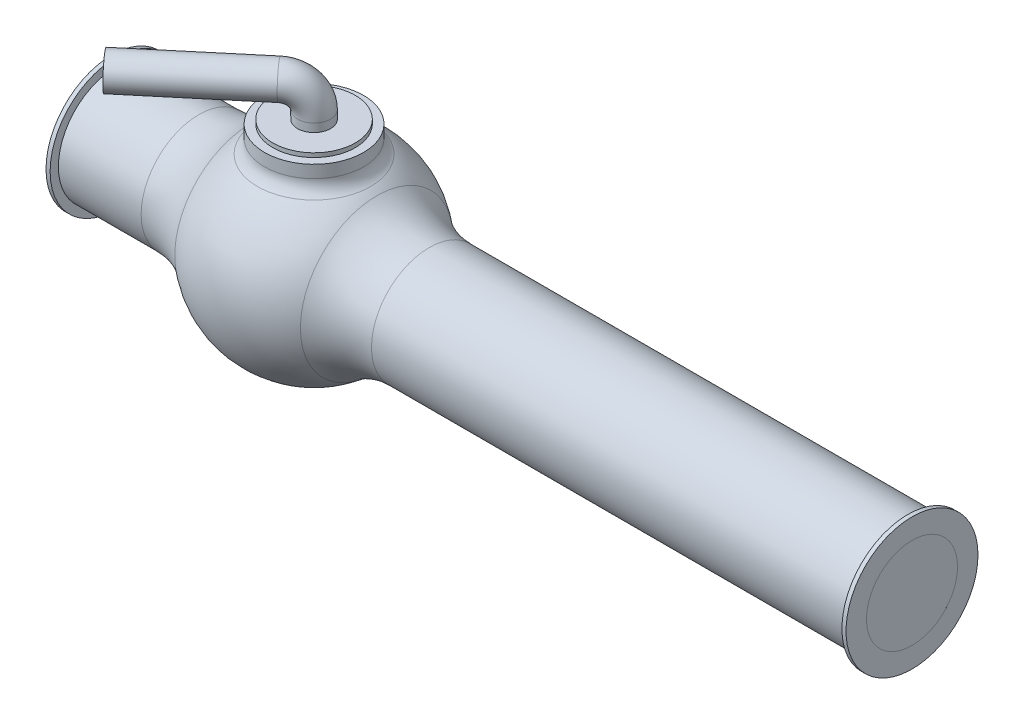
ISO-10303-21;
HEADER;
FILE_DESCRIPTION(('STEP AP214'),'2;1');
FILE_NAME('part.step','',(''),(''),'','','');
FILE_SCHEMA(('AUTOMOTIVE_DESIGN { 1 0 10303 214 1 1 1 1 }'));
ENDSEC;
DATA;
#1=APPLICATION_CONTEXT('core data for automotive mechanical design processes');
#2=APPLICATION_PROTOCOL_DEFINITION('international standard','automotive_design',2000,#1);
#3=PRODUCT_CONTEXT('',#1,'mechanical');
#4=PRODUCT('Part','Part','',(#3));
#5=PRODUCT_RELATED_PRODUCT_CATEGORY('part','',(#4));
#6=PRODUCT_DEFINITION_FORMATION('','',#4);
#7=PRODUCT_DEFINITION_CONTEXT('part definition',#1,'design');
#8=PRODUCT_DEFINITION('design','',#6,#7);
#9=PRODUCT_DEFINITION_SHAPE('','',#8);
#10=(LENGTH_UNIT() NAMED_UNIT(*) SI_UNIT(.MILLI.,.METRE.));
#11=(NAMED_UNIT(*) PLANE_ANGLE_UNIT() SI_UNIT($,.RADIAN.));
#12=(NAMED_UNIT(*) SI_UNIT($,.STERADIAN.) SOLID_ANGLE_UNIT());
#13=UNCERTAINTY_MEASURE_WITH_UNIT(LENGTH_MEASURE(1.E-05),#10,'distance_accuracy_value','');
#14=(GEOMETRIC_REPRESENTATION_CONTEXT(3) GLOBAL_UNCERTAINTY_ASSIGNED_CONTEXT((#13)) GLOBAL_UNIT_ASSIGNED_CONTEXT((#10,
#11,#12)) REPRESENTATION_CONTEXT('',''));
#15=CARTESIAN_POINT('',(0.,0.,0.));
#16=DIRECTION('',(0.,0.,1.));
#17=DIRECTION('',(1.,0.,0.));
#18=AXIS2_PLACEMENT_3D('',#15,#16,#17);
#19=CARTESIAN_POINT('',(0.,0.,0.));
#20=DIRECTION('',(0.,1.,0.));
#21=DIRECTION('',(0.,0.,-1.));
#22=AXIS2_PLACEMENT_3D('',#19,#20,#21);
#23=SPHERICAL_SURFACE('',#22,120.);
#24=CARTESIAN_POINT('',(0.,98.4782167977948,0.));
#25=DIRECTION('',(0.,-1.,0.));
#26=DIRECTION('',(0.,0.,-1.));
#27=AXIS2_PLACEMENT_3D('',#24,#25,#26);
#28=CIRCLE('',#27,68.5714285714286);
#29=CARTESIAN_POINT('',(0.,98.4782167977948,-68.5714285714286));
#30=VERTEX_POINT('',#29);
#31=EDGE_CURVE('P0_E11',#30,#30,#28,.T.);
#32=ORIENTED_EDGE('',*,*,#31,.T.);
#33=EDGE_LOOP('',(#32));
#34=FACE_BOUND('',#33,.T.);
#35=CARTESIAN_POINT('',(76.1685820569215,0.,0.));
#36=DIRECTION('',(-1.,0.,0.));
#37=DIRECTION('',(0.,0.,1.));
#38=AXIS2_PLACEMENT_3D('',#35,#36,#37);
#39=CIRCLE('',#38,92.7272727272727);
#40=CARTESIAN_POINT('',(76.1685820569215,0.,92.7272727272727));
#41=VERTEX_POINT('',#40);
#42=EDGE_CURVE('P0_E91',#41,#41,#39,.T.);
#43=ORIENTED_EDGE('',*,*,#42,.T.);
#44=EDGE_LOOP('',(#43));
#45=FACE_BOUND('',#44,.T.);
#46=CARTESIAN_POINT('',(-76.1685820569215,0.,0.));
#47=DIRECTION('',(1.,0.,0.));
#48=DIRECTION('',(0.,0.,-1.));
#49=AXIS2_PLACEMENT_3D('',#46,#47,#48);
#50=CIRCLE('',#49,92.7272727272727);
#51=CARTESIAN_POINT('',(-76.1685820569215,0.,-92.7272727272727));
#52=VERTEX_POINT('',#51);
#53=EDGE_CURVE('P0_E84',#52,#52,#50,.T.);
#54=ORIENTED_EDGE('',*,*,#53,.T.);
#55=EDGE_LOOP('',(#54));
#56=FACE_BOUND('',#55,.T.);
#57=ADVANCED_FACE('P0_F35',(#34,#45,#56),#23,.T.);
#58=CARTESIAN_POINT('',(0.,0.,0.));
#59=DIRECTION('',(0.,1.,0.));
#60=DIRECTION('',(0.,0.,-1.));
#61=AXIS2_PLACEMENT_3D('',#58,#59,#60);
#62=SPHERICAL_SURFACE('',#61,100.);
#63=CARTESIAN_POINT('',(-83.3885822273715,0.,0.));
#64=DIRECTION('',(1.,0.,0.));
#65=DIRECTION('',(0.,0.,-1.));
#66=AXIS2_PLACEMENT_3D('',#63,#64,#65);
#67=CIRCLE('',#66,55.1936985);
#68=CARTESIAN_POINT('',(-83.3885822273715,-46.099495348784,30.3509618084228));
#69=VERTEX_POINT('',#68);
#70=CARTESIAN_POINT('',(-83.3885822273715,46.0994953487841,30.3509618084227));
#71=VERTEX_POINT('',#70);
#72=EDGE_CURVE('P0_E49',#69,#71,#67,.F.);
#73=ORIENTED_EDGE('',*,*,#72,.T.);
#74=CARTESIAN_POINT('',(-63.879360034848,0.,53.6011474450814));
#75=DIRECTION('',(0.766044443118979,0.,-0.642787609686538));
#76=DIRECTION('',(-0.642787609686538,0.,-0.766044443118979));
#77=AXIS2_PLACEMENT_3D('',#74,#75,#76);
#78=CIRCLE('',#77,55.1936985);
#79=EDGE_CURVE('P0_E71',#71,#69,#78,.T.);
#80=ORIENTED_EDGE('',*,*,#79,.T.);
#81=EDGE_LOOP('',(#73,#80));
#82=FACE_BOUND('',#81,.T.);
#83=ADVANCED_FACE('P0_F79',(#82),#62,.F.);
#84=CARTESIAN_POINT('',(0.,135.,0.));
#85=DIRECTION('',(0.,1.,0.));
#86=DIRECTION('',(0.,0.,1.));
#87=AXIS2_PLACEMENT_3D('',#84,#85,#86);
#88=PLANE('',#87);
#89=CARTESIAN_POINT('',(0.,135.,0.));
#90=DIRECTION('',(0.,1.,0.));
#91=DIRECTION('',(0.,0.,1.));
#92=AXIS2_PLACEMENT_3D('',#89,#90,#91);
#93=CIRCLE('',#92,50.);
#94=CARTESIAN_POINT('',(0.,135.,50.));
#95=VERTEX_POINT('',#94);
#96=EDGE_CURVE('P0_E198',#95,#95,#93,.T.);
#97=ORIENTED_EDGE('',*,*,#96,.T.);
#98=EDGE_LOOP('',(#97));
#99=FACE_BOUND('',#98,.T.);
#100=CARTESIAN_POINT('',(0.,135.,0.));
#101=DIRECTION('',(0.,1.,0.));
#102=DIRECTION('',(0.,0.,1.));
#103=AXIS2_PLACEMENT_3D('',#100,#101,#102);
#104=CIRCLE('',#103,20.);
#105=CARTESIAN_POINT('',(0.,135.,20.));
#106=VERTEX_POINT('',#105);
#107=EDGE_CURVE('P0_E187',#106,#106,#104,.T.);
#108=ORIENTED_EDGE('',*,*,#107,.F.);
#109=EDGE_LOOP('',(#108));
#110=FACE_BOUND('',#109,.T.);
#111=ADVANCED_FACE('P0_F117',(#99,#110),#88,.T.);
#112=CARTESIAN_POINT('',(0.,135.,0.));
#113=DIRECTION('',(0.,-1.,0.));
#114=DIRECTION('',(0.,0.,-1.));
#115=AXIS2_PLACEMENT_3D('',#112,#113,#114);
#116=CYLINDRICAL_SURFACE('',#115,50.);
#117=ORIENTED_EDGE('',*,*,#96,.F.);
#118=EDGE_LOOP('',(#117));
#119=FACE_BOUND('',#118,.T.);
#120=CARTESIAN_POINT('',(0.,130.,0.));
#121=DIRECTION('',(0.,1.,0.));
#122=DIRECTION('',(0.,0.,1.));
#123=AXIS2_PLACEMENT_3D('',#120,#121,#122);
#124=CIRCLE('',#123,50.);
#125=CARTESIAN_POINT('',(0.,130.,50.));
#126=VERTEX_POINT('',#125);
#127=EDGE_CURVE('P0_E184',#126,#126,#124,.T.);
#128=ORIENTED_EDGE('',*,*,#127,.T.);
#129=EDGE_LOOP('',(#128));
#130=FACE_BOUND('',#129,.T.);
#131=ADVANCED_FACE('P0_F145',(#119,#130),#116,.T.);
#132=CARTESIAN_POINT('',(-22.9813332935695,175.,19.2836282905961));
#133=DIRECTION('',(-0.766044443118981,0.,0.642787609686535));
#134=DIRECTION('',(0.642787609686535,0.,0.766044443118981));
#135=AXIS2_PLACEMENT_3D('',#132,#133,#134);
#136=CYLINDRICAL_SURFACE('',#135,20.);
#137=CARTESIAN_POINT('',(-22.9813332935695,175.,19.2836282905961));
#138=DIRECTION('',(-0.766044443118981,0.,0.642787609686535));
#139=DIRECTION('',(0.492403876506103,-0.642787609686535,0.58682408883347));
#140=AXIS2_PLACEMENT_3D('',#137,#138,#139);
#141=CIRCLE('',#140,20.);
#142=CARTESIAN_POINT('',(-22.9813332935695,195.,19.2836282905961));
#143=VERTEX_POINT('',#142);
#144=EDGE_CURVE('P0_E191',#143,#143,#141,.T.);
#145=ORIENTED_EDGE('',*,*,#144,.T.);
#146=EDGE_LOOP('',(#145));
#147=FACE_BOUND('',#146,.T.);
#148=CARTESIAN_POINT('',(-137.887999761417,175.,115.701769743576));
#149=DIRECTION('',(-0.766044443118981,0.,0.642787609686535));
#150=DIRECTION('',(0.492403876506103,-0.642787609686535,0.58682408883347));
#151=AXIS2_PLACEMENT_3D('',#148,#149,#150);
#152=CIRCLE('',#151,20.);
#153=CARTESIAN_POINT('',(-128.039922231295,162.144247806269,127.438251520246));
#154=VERTEX_POINT('',#153);
#155=EDGE_CURVE('P0_E196',#154,#154,#152,.T.);
#156=ORIENTED_EDGE('',*,*,#155,.F.);
#157=EDGE_LOOP('',(#156));
#158=FACE_BOUND('',#157,.T.);
#159=ADVANCED_FACE('P0_F141',(#147,#158),#136,.T.);
#160=CARTESIAN_POINT('',(-22.9813332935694,145.,19.2836282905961));
#161=DIRECTION('',(0.642787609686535,0.,0.766044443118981));
#162=DIRECTION('',(0.766044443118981,0.,-0.642787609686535));
#163=AXIS2_PLACEMENT_3D('',#160,#161,#162);
#164=TOROIDAL_SURFACE('',#163,30.,20.);
#165=CARTESIAN_POINT('',(0.,145.,0.));
#166=DIRECTION('',(0.,1.,0.));
#167=DIRECTION('',(0.,0.,1.));
#168=AXIS2_PLACEMENT_3D('',#165,#166,#167);
#169=CIRCLE('',#168,20.);
#170=CARTESIAN_POINT('',(15.3208888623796,145.,-12.8557521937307));
#171=VERTEX_POINT('',#170);
#172=EDGE_CURVE('P0_E188',#171,#171,#169,.T.);
#173=CARTESIAN_POINT('',(-22.9813332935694,145.,19.2836282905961));
#174=DIRECTION('',(0.642787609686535,0.,0.766044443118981));
#175=DIRECTION('',(0.766044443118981,0.,-0.642787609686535));
#176=AXIS2_PLACEMENT_3D('',#173,#174,#175);
#177=CIRCLE('',#176,50.);
#178=EDGE_CURVE('',#171,#143,#177,.T.);
#179=ORIENTED_EDGE('',*,*,#172,.T.);
#180=ORIENTED_EDGE('',*,*,#144,.F.);
#181=ORIENTED_EDGE('',*,*,#178,.T.);
#182=ORIENTED_EDGE('',*,*,#178,.F.);
#183=EDGE_LOOP('',(#179,#181,#180,#182));
#184=FACE_BOUND('',#183,.T.);
#185=ADVANCED_FACE('P0_F137',(#184),#164,.T.);
#186=CARTESIAN_POINT('',(0.,145.,0.));
#187=DIRECTION('',(0.,-1.,0.));
#188=DIRECTION('',(0.,0.,-1.));
#189=AXIS2_PLACEMENT_3D('',#186,#187,#188);
#190=CYLINDRICAL_SURFACE('',#189,20.);
#191=ORIENTED_EDGE('',*,*,#172,.F.);
#192=EDGE_LOOP('',(#191));
#193=FACE_BOUND('',#192,.T.);
#194=ORIENTED_EDGE('',*,*,#107,.T.);
#195=EDGE_LOOP('',(#194));
#196=FACE_BOUND('',#195,.T.);
#197=ADVANCED_FACE('P0_F133',(#193,#196),#190,.T.);
#198=CARTESIAN_POINT('',(-137.887999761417,175.,115.701769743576));
#199=DIRECTION('',(-0.766044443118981,0.,0.642787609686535));
#200=DIRECTION('',(0.492403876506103,-0.642787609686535,0.58682408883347));
#201=AXIS2_PLACEMENT_3D('',#198,#199,#200);
#202=PLANE('',#201);
#203=ORIENTED_EDGE('',*,*,#155,.T.);
#204=EDGE_LOOP('',(#203));
#205=FACE_BOUND('',#204,.T.);
#206=ADVANCED_FACE('P0_F126',(#205),#202,.T.);
#207=CARTESIAN_POINT('',(0.,180.,0.));
#208=DIRECTION('',(0.,1.,0.));
#209=DIRECTION('',(0.,0.,1.));
#210=AXIS2_PLACEMENT_3D('',#207,#208,#209);
#211=CYLINDRICAL_SURFACE('',#210,60.);
#212=CARTESIAN_POINT('',(0.,114.891252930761,0.));
#213=DIRECTION('',(0.,-1.,0.));
#214=DIRECTION('',(0.,0.,-1.));
#215=AXIS2_PLACEMENT_3D('',#212,#213,#214);
#216=CIRCLE('',#215,60.);
#217=CARTESIAN_POINT('',(0.,114.891252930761,-60.));
#218=VERTEX_POINT('',#217);
#219=EDGE_CURVE('P0_E43',#218,#218,#216,.F.);
#220=ORIENTED_EDGE('',*,*,#219,.T.);
#221=EDGE_LOOP('',(#220));
#222=FACE_BOUND('',#221,.T.);
#223=CARTESIAN_POINT('',(0.,130.,0.));
#224=DIRECTION('',(0.,1.,0.));
#225=DIRECTION('',(0.,0.,1.));
#226=AXIS2_PLACEMENT_3D('',#223,#224,#225);
#227=CIRCLE('',#226,60.);
#228=CARTESIAN_POINT('',(0.,130.,60.));
#229=VERTEX_POINT('',#228);
#230=EDGE_CURVE('P0_E181',#229,#229,#227,.T.);
#231=ORIENTED_EDGE('',*,*,#230,.F.);
#232=EDGE_LOOP('',(#231));
#233=FACE_BOUND('',#232,.T.);
#234=ADVANCED_FACE('P0_F99',(#222,#233),#211,.T.);
#235=CARTESIAN_POINT('',(0.,130.,-40.));
#236=DIRECTION('',(0.,1.,0.));
#237=DIRECTION('',(0.,0.,1.));
#238=AXIS2_PLACEMENT_3D('',#235,#236,#237);
#239=PLANE('',#238);
#240=ORIENTED_EDGE('',*,*,#230,.T.);
#241=EDGE_LOOP('',(#240));
#242=FACE_BOUND('',#241,.T.);
#243=ORIENTED_EDGE('',*,*,#127,.F.);
#244=EDGE_LOOP('',(#243));
#245=FACE_BOUND('',#244,.T.);
#246=ADVANCED_FACE('P0_F125',(#242,#245),#239,.T.);
#247=CARTESIAN_POINT('',(-150.744751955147,0.,0.));
#248=DIRECTION('',(1.,0.,0.));
#249=DIRECTION('',(0.,0.,-1.));
#250=AXIS2_PLACEMENT_3D('',#247,#248,#249);
#251=CYLINDRICAL_SURFACE('',#250,70.);
#252=CARTESIAN_POINT('',(139.642400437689,0.,0.));
#253=DIRECTION('',(-1.,0.,0.));
#254=DIRECTION('',(0.,0.,1.));
#255=AXIS2_PLACEMENT_3D('',#252,#253,#254);
#256=CIRCLE('',#255,70.);
#257=CARTESIAN_POINT('',(139.642400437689,0.,70.));
#258=VERTEX_POINT('',#257);
#259=EDGE_CURVE('P0_E82',#258,#258,#256,.F.);
#260=ORIENTED_EDGE('',*,*,#259,.T.);
#261=EDGE_LOOP('',(#260));
#262=FACE_BOUND('',#261,.T.);
#263=CARTESIAN_POINT('',(720.,0.,0.));
#264=DIRECTION('',(1.,0.,0.));
#265=DIRECTION('',(0.,0.,-1.));
#266=AXIS2_PLACEMENT_3D('',#263,#264,#265);
#267=CIRCLE('',#266,70.);
#268=CARTESIAN_POINT('',(720.,0.,-70.));
#269=VERTEX_POINT('',#268);
#270=EDGE_CURVE('P0_E80',#269,#269,#267,.T.);
#271=ORIENTED_EDGE('',*,*,#270,.F.);
#272=EDGE_LOOP('',(#271));
#273=FACE_BOUND('',#272,.T.);
#274=ADVANCED_FACE('P0_F129',(#262,#273),#251,.T.);
#275=CARTESIAN_POINT('',(107.922796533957,0.,-90.5579787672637));
#276=DIRECTION('',(-0.766044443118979,0.,0.642787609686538));
#277=DIRECTION('',(0.642787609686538,0.,0.766044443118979));
#278=AXIS2_PLACEMENT_3D('',#275,#276,#277);
#279=CYLINDRICAL_SURFACE('',#278,55.1936985);
#280=CARTESIAN_POINT('',(63.879360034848,0.,-53.6011474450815));
#281=DIRECTION('',(-0.766044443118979,0.,0.642787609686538));
#282=DIRECTION('',(0.642787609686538,0.,0.766044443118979));
#283=AXIS2_PLACEMENT_3D('',#280,#281,#282);
#284=CIRCLE('',#283,55.1936985);
#285=CARTESIAN_POINT('',(83.3885822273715,46.0994953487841,-30.3509618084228));
#286=VERTEX_POINT('',#285);
#287=CARTESIAN_POINT('',(83.3885822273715,-46.0994953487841,-30.3509618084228));
#288=VERTEX_POINT('',#287);
#289=EDGE_CURVE('P0_E72',#286,#288,#284,.T.);
#290=ORIENTED_EDGE('',*,*,#289,.F.);
#291=EDGE_CURVE('P0_E200',#288,#286,#284,.T.);
#292=ORIENTED_EDGE('',*,*,#291,.F.);
#293=EDGE_LOOP('',(#290,#292));
#294=FACE_BOUND('',#293,.T.);
#295=ORIENTED_EDGE('',*,*,#79,.F.);
#296=EDGE_CURVE('P0_E65',#69,#71,#78,.T.);
#297=ORIENTED_EDGE('',*,*,#296,.F.);
#298=EDGE_LOOP('',(#295,#297));
#299=FACE_BOUND('',#298,.T.);
#300=ADVANCED_FACE('P0_F81',(#294,#299),#279,.F.);
#301=CARTESIAN_POINT('',(0.,0.,0.));
#302=DIRECTION('',(0.,1.,0.));
#303=DIRECTION('',(0.,0.,-1.));
#304=AXIS2_PLACEMENT_3D('',#301,#302,#303);
#305=SPHERICAL_SURFACE('',#304,100.);
#306=ORIENTED_EDGE('',*,*,#291,.T.);
#307=CARTESIAN_POINT('',(83.3885822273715,0.,0.));
#308=DIRECTION('',(-1.,0.,0.));
#309=DIRECTION('',(0.,0.,1.));
#310=AXIS2_PLACEMENT_3D('',#307,#308,#309);
#311=CIRCLE('',#310,55.1936985);
#312=EDGE_CURVE('P0_E176',#288,#286,#311,.T.);
#313=ORIENTED_EDGE('',*,*,#312,.F.);
#314=EDGE_LOOP('',(#306,#313));
#315=FACE_BOUND('',#314,.T.);
#316=ADVANCED_FACE('P0_F155',(#315),#305,.T.);
#317=ORIENTED_EDGE('',*,*,#289,.T.);
#318=EDGE_CURVE('P0_E56',#286,#288,#311,.T.);
#319=ORIENTED_EDGE('',*,*,#318,.F.);
#320=EDGE_LOOP('',(#317,#319));
#321=FACE_BOUND('',#320,.T.);
#322=ADVANCED_FACE('P0_F119',(#321),#62,.F.);
#323=CARTESIAN_POINT('',(-150.744751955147,0.,0.));
#324=DIRECTION('',(1.,0.,0.));
#325=DIRECTION('',(0.,0.,-1.));
#326=AXIS2_PLACEMENT_3D('',#323,#324,#325);
#327=CYLINDRICAL_SURFACE('',#326,55.1936985);
#328=ORIENTED_EDGE('',*,*,#318,.T.);
#329=ORIENTED_EDGE('',*,*,#312,.T.);
#330=EDGE_LOOP('',(#328,#329));
#331=FACE_BOUND('',#330,.T.);
#332=CARTESIAN_POINT('',(725.,0.,0.));
#333=DIRECTION('',(1.,0.,0.));
#334=DIRECTION('',(0.,0.,-1.));
#335=AXIS2_PLACEMENT_3D('',#332,#333,#334);
#336=CIRCLE('',#335,55.1936985);
#337=CARTESIAN_POINT('',(725.,0.,-55.1936985));
#338=VERTEX_POINT('',#337);
#339=EDGE_CURVE('P0_E260',#338,#338,#336,.T.);
#340=ORIENTED_EDGE('',*,*,#339,.T.);
#341=EDGE_LOOP('',(#340));
#342=FACE_BOUND('',#341,.T.);
#343=ADVANCED_FACE('P0_F208',(#331,#342),#327,.F.);
#344=CARTESIAN_POINT('',(0.,0.,0.));
#345=DIRECTION('',(0.,1.,0.));
#346=DIRECTION('',(0.,0.,-1.));
#347=AXIS2_PLACEMENT_3D('',#344,#345,#346);
#348=SPHERICAL_SURFACE('',#347,100.);
#349=ORIENTED_EDGE('',*,*,#296,.T.);
#350=EDGE_CURVE('P0_E67',#71,#69,#67,.F.);
#351=ORIENTED_EDGE('',*,*,#350,.T.);
#352=EDGE_LOOP('',(#349,#351));
#353=FACE_BOUND('',#352,.T.);
#354=ADVANCED_FACE('P0_F66',(#353),#348,.T.);
#355=CARTESIAN_POINT('',(720.001,0.,0.));
#356=DIRECTION('',(-1.,0.,0.));
#357=DIRECTION('',(0.,0.,1.));
#358=AXIS2_PLACEMENT_3D('',#355,#356,#357);
#359=CYLINDRICAL_SURFACE('',#358,55.1936985);
#360=ORIENTED_EDGE('',*,*,#72,.F.);
#361=ORIENTED_EDGE('',*,*,#350,.F.);
#362=EDGE_LOOP('',(#360,#361));
#363=FACE_BOUND('',#362,.T.);
#364=CARTESIAN_POINT('',(-245.,0.,0.));
#365=DIRECTION('',(-1.,0.,0.));
#366=DIRECTION('',(0.,0.,1.));
#367=AXIS2_PLACEMENT_3D('',#364,#365,#366);
#368=CIRCLE('',#367,55.1936985);
#369=CARTESIAN_POINT('',(-245.,0.,55.1936985));
#370=VERTEX_POINT('',#369);
#371=EDGE_CURVE('P0_E250',#370,#370,#368,.T.);
#372=ORIENTED_EDGE('',*,*,#371,.T.);
#373=EDGE_LOOP('',(#372));
#374=FACE_BOUND('',#373,.T.);
#375=ADVANCED_FACE('P0_F74',(#363,#374),#359,.F.);
#376=CARTESIAN_POINT('',(720.001,0.,0.));
#377=DIRECTION('',(-1.,0.,0.));
#378=DIRECTION('',(0.,0.,1.));
#379=AXIS2_PLACEMENT_3D('',#376,#377,#378);
#380=CYLINDRICAL_SURFACE('',#379,70.);
#381=CARTESIAN_POINT('',(-139.642400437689,0.,0.));
#382=DIRECTION('',(1.,0.,0.));
#383=DIRECTION('',(0.,0.,-1.));
#384=AXIS2_PLACEMENT_3D('',#381,#382,#383);
#385=CIRCLE('',#384,70.);
#386=CARTESIAN_POINT('',(-139.642400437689,0.,-70.));
#387=VERTEX_POINT('',#386);
#388=EDGE_CURVE('P0_E94',#387,#387,#385,.F.);
#389=ORIENTED_EDGE('',*,*,#388,.T.);
#390=EDGE_LOOP('',(#389));
#391=FACE_BOUND('',#390,.T.);
#392=CARTESIAN_POINT('',(-240.,0.,0.));
#393=DIRECTION('',(-1.,0.,0.));
#394=DIRECTION('',(0.,0.,1.));
#395=AXIS2_PLACEMENT_3D('',#392,#393,#394);
#396=CIRCLE('',#395,70.);
#397=CARTESIAN_POINT('',(-240.,0.,70.));
#398=VERTEX_POINT('',#397);
#399=EDGE_CURVE('P0_E256',#398,#398,#396,.T.);
#400=ORIENTED_EDGE('',*,*,#399,.F.);
#401=EDGE_LOOP('',(#400));
#402=FACE_BOUND('',#401,.T.);
#403=ADVANCED_FACE('P0_F221',(#391,#402),#380,.T.);
#404=CARTESIAN_POINT('',(725.,0.,0.));
#405=DIRECTION('',(1.,0.,0.));
#406=DIRECTION('',(0.,0.,-1.));
#407=AXIS2_PLACEMENT_3D('',#404,#405,#406);
#408=PLANE('',#407);
#409=CARTESIAN_POINT('',(725.,0.,0.));
#410=DIRECTION('',(1.,0.,0.));
#411=DIRECTION('',(0.,0.,-1.));
#412=AXIS2_PLACEMENT_3D('',#409,#410,#411);
#413=CIRCLE('',#412,80.);
#414=CARTESIAN_POINT('',(725.,0.,-80.));
#415=VERTEX_POINT('',#414);
#416=EDGE_CURVE('P0_E76',#415,#415,#413,.T.);
#417=ORIENTED_EDGE('',*,*,#416,.T.);
#418=EDGE_LOOP('',(#417));
#419=FACE_BOUND('',#418,.T.);
#420=ORIENTED_EDGE('',*,*,#339,.F.);
#421=EDGE_LOOP('',(#420));
#422=FACE_BOUND('',#421,.T.);
#423=ADVANCED_FACE('P0_F224',(#419,#422),#408,.T.);
#424=CARTESIAN_POINT('',(720.,0.,0.));
#425=DIRECTION('',(1.,0.,0.));
#426=DIRECTION('',(0.,0.,-1.));
#427=AXIS2_PLACEMENT_3D('',#424,#425,#426);
#428=PLANE('',#427);
#429=ORIENTED_EDGE('',*,*,#270,.T.);
#430=EDGE_LOOP('',(#429));
#431=FACE_BOUND('',#430,.T.);
#432=CARTESIAN_POINT('',(720.,0.,0.));
#433=DIRECTION('',(1.,0.,0.));
#434=DIRECTION('',(0.,0.,-1.));
#435=AXIS2_PLACEMENT_3D('',#432,#433,#434);
#436=CIRCLE('',#435,80.);
#437=CARTESIAN_POINT('',(720.,0.,-80.));
#438=VERTEX_POINT('',#437);
#439=EDGE_CURVE('P0_E263',#438,#438,#436,.T.);
#440=ORIENTED_EDGE('',*,*,#439,.F.);
#441=EDGE_LOOP('',(#440));
#442=FACE_BOUND('',#441,.T.);
#443=ADVANCED_FACE('P0_F230',(#431,#442),#428,.F.);
#444=CARTESIAN_POINT('',(725.,0.,0.));
#445=DIRECTION('',(-1.,0.,0.));
#446=DIRECTION('',(0.,0.,1.));
#447=AXIS2_PLACEMENT_3D('',#444,#445,#446);
#448=CYLINDRICAL_SURFACE('',#447,80.);
#449=ORIENTED_EDGE('',*,*,#416,.F.);
#450=EDGE_LOOP('',(#449));
#451=FACE_BOUND('',#450,.T.);
#452=ORIENTED_EDGE('',*,*,#439,.T.);
#453=EDGE_LOOP('',(#452));
#454=FACE_BOUND('',#453,.T.);
#455=ADVANCED_FACE('P0_F226',(#451,#454),#448,.T.);
#456=CARTESIAN_POINT('',(-240.,0.,0.));
#457=DIRECTION('',(-1.,0.,0.));
#458=DIRECTION('',(0.,0.,1.));
#459=AXIS2_PLACEMENT_3D('',#456,#457,#458);
#460=PLANE('',#459);
#461=CARTESIAN_POINT('',(-240.,0.,0.));
#462=DIRECTION('',(-1.,0.,0.));
#463=DIRECTION('',(0.,0.,1.));
#464=AXIS2_PLACEMENT_3D('',#461,#462,#463);
#465=CIRCLE('',#464,80.);
#466=CARTESIAN_POINT('',(-240.,0.,80.));
#467=VERTEX_POINT('',#466);
#468=EDGE_CURVE('P0_E251',#467,#467,#465,.T.);
#469=ORIENTED_EDGE('',*,*,#468,.F.);
#470=EDGE_LOOP('',(#469));
#471=FACE_BOUND('',#470,.T.);
#472=ORIENTED_EDGE('',*,*,#399,.T.);
#473=EDGE_LOOP('',(#472));
#474=FACE_BOUND('',#473,.T.);
#475=ADVANCED_FACE('P0_F229',(#471,#474),#460,.F.);
#476=CARTESIAN_POINT('',(-245.,0.,0.));
#477=DIRECTION('',(-1.,0.,0.));
#478=DIRECTION('',(0.,0.,1.));
#479=AXIS2_PLACEMENT_3D('',#476,#477,#478);
#480=PLANE('',#479);
#481=CARTESIAN_POINT('',(-245.,0.,0.));
#482=DIRECTION('',(-1.,0.,0.));
#483=DIRECTION('',(0.,0.,1.));
#484=AXIS2_PLACEMENT_3D('',#481,#482,#483);
#485=CIRCLE('',#484,80.);
#486=CARTESIAN_POINT('',(-245.,0.,80.));
#487=VERTEX_POINT('',#486);
#488=EDGE_CURVE('P0_E247',#487,#487,#485,.T.);
#489=ORIENTED_EDGE('',*,*,#488,.T.);
#490=EDGE_LOOP('',(#489));
#491=FACE_BOUND('',#490,.T.);
#492=ORIENTED_EDGE('',*,*,#371,.F.);
#493=EDGE_LOOP('',(#492));
#494=FACE_BOUND('',#493,.T.);
#495=ADVANCED_FACE('P0_F163',(#491,#494),#480,.T.);
#496=CARTESIAN_POINT('',(-245.,0.,0.));
#497=DIRECTION('',(1.,0.,0.));
#498=DIRECTION('',(0.,0.,-1.));
#499=AXIS2_PLACEMENT_3D('',#496,#497,#498);
#500=CYLINDRICAL_SURFACE('',#499,80.);
#501=ORIENTED_EDGE('',*,*,#488,.F.);
#502=EDGE_LOOP('',(#501));
#503=FACE_BOUND('',#502,.T.);
#504=ORIENTED_EDGE('',*,*,#468,.T.);
#505=EDGE_LOOP('',(#504));
#506=FACE_BOUND('',#505,.T.);
#507=ADVANCED_FACE('P0_F158',(#503,#506),#500,.T.);
#508=CARTESIAN_POINT('',(139.642400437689,0.,0.));
#509=DIRECTION('',(-1.,0.,0.));
#510=DIRECTION('',(0.,0.,1.));
#511=AXIS2_PLACEMENT_3D('',#508,#509,#510);
#512=TOROIDAL_SURFACE('',#511,170.,100.);
#513=ORIENTED_EDGE('',*,*,#42,.F.);
#514=EDGE_LOOP('',(#513));
#515=FACE_BOUND('',#514,.T.);
#516=ORIENTED_EDGE('',*,*,#259,.F.);
#517=EDGE_LOOP('',(#516));
#518=FACE_BOUND('',#517,.T.);
#519=ADVANCED_FACE('P0_F108',(#515,#518),#512,.F.);
#520=CARTESIAN_POINT('',(-139.642400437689,0.,0.));
#521=DIRECTION('',(1.,0.,0.));
#522=DIRECTION('',(0.,0.,-1.));
#523=AXIS2_PLACEMENT_3D('',#520,#521,#522);
#524=TOROIDAL_SURFACE('',#523,170.,100.);
#525=ORIENTED_EDGE('',*,*,#53,.F.);
#526=EDGE_LOOP('',(#525));
#527=FACE_BOUND('',#526,.T.);
#528=ORIENTED_EDGE('',*,*,#388,.F.);
#529=EDGE_LOOP('',(#528));
#530=FACE_BOUND('',#529,.T.);
#531=ADVANCED_FACE('P0_F103',(#527,#530),#524,.F.);
#532=CARTESIAN_POINT('',(0.,114.891252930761,0.));
#533=DIRECTION('',(0.,-1.,0.));
#534=DIRECTION('',(0.,0.,-1.));
#535=AXIS2_PLACEMENT_3D('',#532,#533,#534);
#536=TOROIDAL_SURFACE('',#535,80.,20.);
#537=ORIENTED_EDGE('',*,*,#31,.F.);
#538=EDGE_LOOP('',(#537));
#539=FACE_BOUND('',#538,.T.);
#540=ORIENTED_EDGE('',*,*,#219,.F.);
#541=EDGE_LOOP('',(#540));
#542=FACE_BOUND('',#541,.T.);
#543=ADVANCED_FACE('P0_F37',(#539,#542),#536,.F.);
#544=CLOSED_SHELL('',(#57,#83,#111,#131,#159,#185,#197,#206,#234,#246,#274,#300,#316,#322,#343,
#354,#375,#403,#423,#443,#455,#475,#495,#507,#519,#531,#543));
#545=MANIFOLD_SOLID_BREP('P0_B2',#544);
#546=CARTESIAN_POINT('',(-239.747482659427,0.,56.7548120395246));
#547=CARTESIAN_POINT('',(-239.747482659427,-1.85738434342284,56.7547902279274));
#548=CARTESIAN_POINT('',(-239.747482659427,-5.57205588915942,56.5735678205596));
#549=CARTESIAN_POINT('',(-239.747482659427,-11.0899439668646,55.7531503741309));
#550=CARTESIAN_POINT('',(-239.747482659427,-16.5018319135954,54.3995668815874));
#551=CARTESIAN_POINT('',(-239.747482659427,-21.7536265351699,52.5183705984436));
#552=CARTESIAN_POINT('',(-239.747482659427,-26.7975888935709,50.1349505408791));
#553=CARTESIAN_POINT('',(-239.747482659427,-31.5814658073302,47.265319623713));
#554=CARTESIAN_POINT('',(-239.747482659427,-36.0635220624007,43.9436685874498));
#555=CARTESIAN_POINT('',(-239.747482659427,-40.1956431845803,40.1958914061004));
#556=CARTESIAN_POINT('',(-239.747482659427,-43.9435589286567,36.0636615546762));
#557=CARTESIAN_POINT('',(-239.747482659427,-47.2651245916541,31.5817576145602));
#558=CARTESIAN_POINT('',(-239.747482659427,-50.1348638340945,26.7977435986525));
#559=CARTESIAN_POINT('',(-239.747482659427,-52.5182337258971,21.7539546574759));
#560=CARTESIAN_POINT('',(-239.747482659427,-54.3995204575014,16.5020068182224));
#561=CARTESIAN_POINT('',(-239.747482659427,-55.7530966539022,11.0901593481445));
#562=CARTESIAN_POINT('',(-239.747482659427,-56.5736269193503,5.57210506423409));
#563=CARTESIAN_POINT('',(-239.747482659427,-56.8453995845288,0.000179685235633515));
#564=CARTESIAN_POINT('',(-239.747482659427,-56.573646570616,-5.57192449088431));
#565=CARTESIAN_POINT('',(-239.747482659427,-55.7531667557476,-11.0898069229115));
#566=CARTESIAN_POINT('',(-239.747482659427,-54.3995714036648,-16.5018324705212));
#567=CARTESIAN_POINT('',(-239.747482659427,-52.5183712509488,-21.7536226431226));
#568=CARTESIAN_POINT('',(-239.747482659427,-50.1349510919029,-26.7975842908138));
#569=CARTESIAN_POINT('',(-239.747482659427,-47.265324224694,-31.5814588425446));
#570=CARTESIAN_POINT('',(-239.747482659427,-43.9436727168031,-36.0635199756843));
#571=CARTESIAN_POINT('',(-239.747482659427,-40.1958972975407,-40.195637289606));
#572=CARTESIAN_POINT('',(-239.747482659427,-36.0636636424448,-43.9435548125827));
#573=CARTESIAN_POINT('',(-239.747482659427,-31.5817645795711,-47.2651199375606));
#574=CARTESIAN_POINT('',(-239.747482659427,-26.7977481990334,-50.1348634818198));
#575=CARTESIAN_POINT('',(-239.747482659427,-21.7539623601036,-52.5182305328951));
#576=CARTESIAN_POINT('',(-239.747482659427,-16.5020103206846,-54.3995174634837));
#577=CARTESIAN_POINT('',(-239.747482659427,-11.0901675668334,-55.753094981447));
#578=CARTESIAN_POINT('',(-239.747482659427,-5.57210944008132,-56.5736284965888));
#579=CARTESIAN_POINT('',(-239.747482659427,-0.00018385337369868,-56.8453992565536));
#580=CARTESIAN_POINT('',(-239.747482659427,5.57192448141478,-56.5736467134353));
#581=CARTESIAN_POINT('',(-239.747482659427,11.0898069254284,-55.7531667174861));
#582=CARTESIAN_POINT('',(-239.747482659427,16.5018324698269,-54.3995714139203));
#583=CARTESIAN_POINT('',(-239.747482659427,21.7536226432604,-52.5183712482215));
#584=CARTESIAN_POINT('',(-239.747482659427,26.7975842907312,-50.1349510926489));
#585=CARTESIAN_POINT('',(-239.747482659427,31.5814588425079,-47.265324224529));
#586=CARTESIAN_POINT('',(-239.747482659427,36.0635199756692,-43.9436727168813));
#587=CARTESIAN_POINT('',(-239.747482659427,40.1956372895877,-40.1958972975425));
#588=CARTESIAN_POINT('',(-239.747482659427,43.9435548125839,-36.0636636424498));
#589=CARTESIAN_POINT('',(-239.747482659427,47.2651199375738,-31.5817645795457));
#590=CARTESIAN_POINT('',(-239.747482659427,50.1348634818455,-26.7977481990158));
#591=CARTESIAN_POINT('',(-239.747482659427,52.5182305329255,-21.7539623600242));
#592=CARTESIAN_POINT('',(-239.747482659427,54.3995174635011,-16.5020103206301));
#593=CARTESIAN_POINT('',(-239.747482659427,55.753094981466,-11.0901675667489));
#594=CARTESIAN_POINT('',(-239.747482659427,56.5736284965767,-5.57210944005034));
#595=CARTESIAN_POINT('',(-239.747482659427,56.8453992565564,-0.000183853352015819));
#596=CARTESIAN_POINT('',(-239.747482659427,56.5736467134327,5.57192448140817));
#597=CARTESIAN_POINT('',(-239.747482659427,55.7531667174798,11.0898069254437));
#598=CARTESIAN_POINT('',(-239.747482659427,54.3995714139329,16.5018324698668));
#599=CARTESIAN_POINT('',(-239.747482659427,52.5183712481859,21.7536226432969));
#600=CARTESIAN_POINT('',(-239.747482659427,50.1349510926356,26.7975842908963));
#601=CARTESIAN_POINT('',(-239.747482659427,47.2653242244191,31.5814588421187));
#602=CARTESIAN_POINT('',(-239.747482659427,43.9436727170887,36.063519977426));
#603=CARTESIAN_POINT('',(-239.747482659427,40.1958972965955,40.1956372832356));
#604=CARTESIAN_POINT('',(-239.747482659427,36.0636636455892,43.9435548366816));
#605=CARTESIAN_POINT('',(-239.747482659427,31.5817645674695,47.2651198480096));
#606=CARTESIAN_POINT('',(-239.747482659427,26.7977482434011,50.1348638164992));
#607=CARTESIAN_POINT('',(-239.747482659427,21.7539621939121,52.5182292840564));
#608=CARTESIAN_POINT('',(-239.747482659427,16.50201094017,54.3995221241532));
#609=CARTESIAN_POINT('',(-239.747482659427,11.090030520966,55.7531112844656));
#610=CARTESIAN_POINT('',(-239.747482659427,5.57197805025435,56.5737074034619));
#611=CARTESIAN_POINT('',(-239.747482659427,1.85729364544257,56.7548338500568));
#612=CARTESIAN_POINT('',(-239.747482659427,0.,56.7548120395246));
#613=B_SPLINE_CURVE_WITH_KNOTS('',3,(#546,#547,#548,#549,#550,#551,#552,#553,#554,#555,#556,
#557,#558,#559,#560,#561,#562,#563,#564,#565,#566,#567,#568,#569,#570,#571,#572,#573,#574,#575,
#576,#577,#578,#579,#580,#581,#582,#583,#584,#585,#586,#587,#588,#589,#590,#591,#592,#593,#594,
#595,#596,#597,#598,#599,#600,#601,#602,#603,#604,#605,#606,#607,#608,#609,#610,#611,#612),
.UNSPECIFIED.,.T.,.F.,(4,1,1,1,1,1,1,1,1,1,1,1,1,1,1,1,1,1,1,1,1,1,1,1,1,1,1,1,1,1,1,1,1,1,1,1,
1,1,1,1,1,1,1,1,1,1,1,1,1,1,1,1,1,1,1,1,1,1,1,1,1,1,1,1,4),(0.,0.0156253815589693,
0.0312499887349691,0.0468742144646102,0.0624999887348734,0.0781242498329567,0.0937499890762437,
0.109374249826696,0.124999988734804,0.140624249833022,0.156249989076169,0.171874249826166,
0.187499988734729,0.203124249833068,0.2187499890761,0.234374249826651,0.249999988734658,
0.265624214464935,0.281249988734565,0.296874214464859,0.312499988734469,0.328124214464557,
0.343749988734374,0.359374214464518,0.37499998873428,0.390624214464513,0.406249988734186,
0.421874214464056,0.437499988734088,0.453124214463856,0.468749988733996,0.48437421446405,
0.499999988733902,0.515624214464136,0.531249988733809,0.546874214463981,0.562499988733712,
0.578124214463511,0.593749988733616,0.609374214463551,0.624999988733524,0.640624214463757,
0.65624998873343,0.671874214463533,0.687499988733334,0.703124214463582,0.718749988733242,
0.734374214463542,0.749999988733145,0.765624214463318,0.781249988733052,0.796874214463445,
0.812499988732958,0.828124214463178,0.843749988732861,0.859374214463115,0.87499998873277,
0.890624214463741,0.906249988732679,0.921874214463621,0.93749998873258,0.953124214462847,
0.968749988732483,0.984375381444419,1.),.UNSPECIFIED.);
#614=DIRECTION('',(-1.,0.,0.));
#615=VECTOR('',#614,1.);
#616=SURFACE_OF_LINEAR_EXTRUSION('',#613,#615);
#617=CARTESIAN_POINT('',(-239.747482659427,8.09655093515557E-09,56.7548120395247));
#618=CARTESIAN_POINT('',(-239.747482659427,0.914365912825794,56.7548195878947));
#619=CARTESIAN_POINT('',(-239.747482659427,1.82875173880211,56.7328770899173));
#620=CARTESIAN_POINT('',(-239.747482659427,3.65537357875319,56.6448668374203));
#621=CARTESIAN_POINT('',(-239.747482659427,4.56760964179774,56.5788001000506));
#622=CARTESIAN_POINT('',(-239.747482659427,6.38778340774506,56.4023163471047));
#623=CARTESIAN_POINT('',(-239.747482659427,7.29572111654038,56.2918993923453));
#624=CARTESIAN_POINT('',(-239.747482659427,9.10521489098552,56.0273302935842));
#625=CARTESIAN_POINT('',(-239.747482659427,10.006770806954,55.8731771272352));
#626=CARTESIAN_POINT('',(-239.747482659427,11.8014479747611,55.5217848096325));
#627=CARTESIAN_POINT('',(-239.747482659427,12.6945692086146,55.3245455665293));
#628=CARTESIAN_POINT('',(-239.747482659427,14.470243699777,54.8872144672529));
#629=CARTESIAN_POINT('',(-239.747482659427,15.3527971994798,54.6471235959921));
#630=CARTESIAN_POINT('',(-239.747482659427,17.1051659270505,54.1242575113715));
#631=CARTESIAN_POINT('',(-239.747482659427,17.9749812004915,53.8414824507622));
#632=CARTESIAN_POINT('',(-239.747482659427,19.6999378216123,53.2342104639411));
#633=CARTESIAN_POINT('',(-239.747482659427,20.5550788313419,52.9097125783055));
#634=CARTESIAN_POINT('',(-239.747482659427,22.2488017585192,52.2200432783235));
#635=CARTESIAN_POINT('',(-239.747482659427,23.0873836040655,51.8548716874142));
#636=CARTESIAN_POINT('',(-239.747482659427,24.7459532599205,51.0845258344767));
#637=CARTESIAN_POINT('',(-239.747482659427,25.5659414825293,50.6793524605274));
#638=CARTESIAN_POINT('',(-239.747482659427,27.1852203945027,49.8295739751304));
#639=CARTESIAN_POINT('',(-239.747482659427,27.9845112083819,49.3849691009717));
#640=CARTESIAN_POINT('',(-239.747482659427,29.5606610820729,48.4576081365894));
#641=CARTESIAN_POINT('',(-239.747482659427,30.3375196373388,47.9748511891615));
#642=CARTESIAN_POINT('',(-239.747482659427,31.8671687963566,46.9725974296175));
#643=CARTESIAN_POINT('',(-239.747482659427,32.6199592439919,46.4531003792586));
#644=CARTESIAN_POINT('',(-239.747482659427,34.0996219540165,45.3784416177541));
#645=CARTESIAN_POINT('',(-239.747482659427,34.8264947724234,44.8232806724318));
#646=CARTESIAN_POINT('',(-239.747482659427,36.2523601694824,43.678248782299));
#647=CARTESIAN_POINT('',(-239.747482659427,36.9513529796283,43.0883781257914));
#648=CARTESIAN_POINT('',(-239.747482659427,38.3199741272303,41.875482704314));
#649=CARTESIAN_POINT('',(-239.747482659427,38.9896018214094,41.25245721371));
#650=CARTESIAN_POINT('',(-239.747482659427,40.2981737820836,39.974968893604));
#651=CARTESIAN_POINT('',(-239.747482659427,40.9371177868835,39.3205057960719));
#652=CARTESIAN_POINT('',(-239.747482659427,42.1827361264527,37.9815752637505));
#653=CARTESIAN_POINT('',(-239.747482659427,42.7894111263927,37.2971084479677));
#654=CARTESIAN_POINT('',(-239.747482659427,43.9687437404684,35.899479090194));
#655=CARTESIAN_POINT('',(-239.747482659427,44.5414017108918,35.1863168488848));
#656=CARTESIAN_POINT('',(-239.747482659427,45.651505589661,33.7330786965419));
#657=CARTESIAN_POINT('',(-239.747482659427,46.1889507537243,32.9930022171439));
#658=CARTESIAN_POINT('',(-239.747482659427,47.2276813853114,31.4878866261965));
#659=CARTESIAN_POINT('',(-239.747482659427,47.728966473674,30.7228472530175));
#660=CARTESIAN_POINT('',(-239.747482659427,48.694122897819,29.1695348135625));
#661=CARTESIAN_POINT('',(-239.747482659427,49.1579949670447,28.3812622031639));
#662=CARTESIAN_POINT('',(-239.747482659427,50.0468591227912,26.7831015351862));
#663=CARTESIAN_POINT('',(-239.747482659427,50.4718516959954,25.9732137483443));
#664=CARTESIAN_POINT('',(-239.747482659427,51.2820823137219,24.3337775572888));
#665=CARTESIAN_POINT('',(-239.747482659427,51.6673195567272,23.5042287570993));
#666=CARTESIAN_POINT('',(-239.747482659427,52.3975011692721,21.827575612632));
#667=CARTESIAN_POINT('',(-239.747482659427,52.742445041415,20.9804710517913));
#668=CARTESIAN_POINT('',(-239.747482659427,53.3911720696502,19.2706565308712));
#669=CARTESIAN_POINT('',(-239.747482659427,53.6949559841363,18.4079468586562));
#670=CARTESIAN_POINT('',(-239.747482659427,54.2602364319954,16.6687920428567));
#671=CARTESIAN_POINT('',(-239.747482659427,54.5217335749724,15.792347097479));
#672=CARTESIAN_POINT('',(-239.747482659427,55.0019077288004,14.0277931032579));
#673=CARTESIAN_POINT('',(-239.747482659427,55.2205839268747,13.1396838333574));
#674=CARTESIAN_POINT('',(-239.747482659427,55.6150076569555,11.35397473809));
#675=CARTESIAN_POINT('',(-239.747482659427,55.7907545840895,10.4563747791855));
#676=CARTESIAN_POINT('',(-239.747482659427,56.0988755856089,8.65377127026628));
#677=CARTESIAN_POINT('',(-239.747482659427,56.2312504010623,7.7487678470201));
#678=CARTESIAN_POINT('',(-239.747482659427,56.4518861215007,5.93340936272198));
#679=CARTESIAN_POINT('',(-239.747482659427,56.540147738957,5.02305438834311));
#680=CARTESIAN_POINT('',(-239.747482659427,56.6723790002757,3.19912272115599));
#681=CARTESIAN_POINT('',(-239.747482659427,56.7163478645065,2.28554597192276));
#682=CARTESIAN_POINT('',(-239.747482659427,56.760317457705,0.457325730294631));
#683=CARTESIAN_POINT('',(-239.747482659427,56.7603174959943,-0.457317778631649));
#684=CARTESIAN_POINT('',(-239.747482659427,56.7163480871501,-2.28553812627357));
#685=CARTESIAN_POINT('',(-239.747482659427,56.6723793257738,-3.19911498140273));
#686=CARTESIAN_POINT('',(-239.747482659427,56.5401483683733,-5.02304677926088));
#687=CARTESIAN_POINT('',(-239.747482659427,56.451886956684,-5.93340177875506));
#688=CARTESIAN_POINT('',(-239.747482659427,56.2312515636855,-7.74876020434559));
#689=CARTESIAN_POINT('',(-239.747482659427,56.0988768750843,-8.6537635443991));
#690=CARTESIAN_POINT('',(-239.747482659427,55.7907560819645,-10.4563669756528));
#691=CARTESIAN_POINT('',(-239.747482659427,55.6150092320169,-11.3539669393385));
#692=CARTESIAN_POINT('',(-239.747482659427,55.220585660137,-13.1396761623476));
#693=CARTESIAN_POINT('',(-239.747482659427,55.0019095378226,-14.0277855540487));
#694=CARTESIAN_POINT('',(-239.747482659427,54.5217356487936,-15.7923397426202));
#695=CARTESIAN_POINT('',(-239.747482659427,54.2602386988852,-16.6687847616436));
#696=CARTESIAN_POINT('',(-239.747482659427,53.6949585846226,-18.4079395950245));
#697=CARTESIAN_POINT('',(-239.747482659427,53.3911748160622,-19.2706492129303));
#698=CARTESIAN_POINT('',(-239.747482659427,52.7424480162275,-20.9804636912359));
#699=CARTESIAN_POINT('',(-239.747482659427,52.3975042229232,-21.8275682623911));
#700=CARTESIAN_POINT('',(-239.747482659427,51.6673227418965,-23.5042215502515));
#701=CARTESIAN_POINT('',(-239.747482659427,51.282085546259,-24.3337704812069));
#702=CARTESIAN_POINT('',(-239.747482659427,50.471855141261,-25.9732069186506));
#703=CARTESIAN_POINT('',(-239.747482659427,50.0468627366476,-26.7830948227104));
#704=CARTESIAN_POINT('',(-239.747482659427,49.1579989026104,-28.3812555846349));
#705=CARTESIAN_POINT('',(-239.747482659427,48.6941269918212,-29.1695281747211));
#706=CARTESIAN_POINT('',(-239.747482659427,47.7289708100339,-30.7228406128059));
#707=CARTESIAN_POINT('',(-239.747482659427,47.2276858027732,-31.487880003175));
#708=CARTESIAN_POINT('',(-239.747482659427,46.1889552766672,-32.99299574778));
#709=CARTESIAN_POINT('',(-239.747482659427,45.6515101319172,-33.7330723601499));
#710=CARTESIAN_POINT('',(-239.747482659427,44.5414064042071,-35.1863107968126));
#711=CARTESIAN_POINT('',(-239.747482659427,43.9687485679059,-35.8994731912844));
#712=CARTESIAN_POINT('',(-239.747482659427,42.7894162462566,-37.2971027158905));
#713=CARTESIAN_POINT('',(-239.747482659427,42.1827414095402,-37.9815695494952));
#714=CARTESIAN_POINT('',(-239.747482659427,40.9371233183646,-39.3205001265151));
#715=CARTESIAN_POINT('',(-239.747482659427,40.2981793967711,-39.9749632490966));
#716=CARTESIAN_POINT('',(-239.747482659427,38.9896075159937,-41.2524517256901));
#717=CARTESIAN_POINT('',(-239.747482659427,38.3199798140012,-41.8754773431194));
#718=CARTESIAN_POINT('',(-239.747482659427,36.9513587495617,-43.0883730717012));
#719=CARTESIAN_POINT('',(-239.747482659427,36.2523660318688,-43.6782439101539));
#720=CARTESIAN_POINT('',(-239.747482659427,34.8265008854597,-44.8232760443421));
#721=CARTESIAN_POINT('',(-239.747482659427,34.0996282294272,-45.3784370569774));
#722=CARTESIAN_POINT('',(-239.747482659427,32.619965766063,-46.4530959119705));
#723=CARTESIAN_POINT('',(-239.747482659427,31.8671754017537,-46.9725929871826));
#724=CARTESIAN_POINT('',(-239.747482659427,30.3375262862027,-47.9748468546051));
#725=CARTESIAN_POINT('',(-239.747482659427,29.5606676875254,-48.4576038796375));
#726=CARTESIAN_POINT('',(-239.747482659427,27.9845178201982,-49.3849651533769));
#727=CARTESIAN_POINT('',(-239.747482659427,27.1852270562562,-49.8295702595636));
#728=CARTESIAN_POINT('',(-239.747482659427,25.5659483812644,-50.679349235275));
#729=CARTESIAN_POINT('',(-239.747482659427,24.745960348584,-51.0845228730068));
#730=CARTESIAN_POINT('',(-239.747482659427,23.0873909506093,-51.8548689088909));
#731=CARTESIAN_POINT('',(-239.747482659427,22.2488091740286,-52.2200404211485));
#732=CARTESIAN_POINT('',(-239.747482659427,20.555086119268,-52.9097091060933));
#733=CARTESIAN_POINT('',(-239.747482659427,19.6999449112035,-53.2342064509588));
#734=CARTESIAN_POINT('',(-239.747482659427,17.9749881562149,-53.8414785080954));
#735=CARTESIAN_POINT('',(-239.747482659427,17.1051729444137,-54.1242541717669));
#736=CARTESIAN_POINT('',(-239.747482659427,15.3528048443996,-54.647123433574));
#737=CARTESIAN_POINT('',(-239.747482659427,14.4702519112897,-54.8872168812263));
#738=CARTESIAN_POINT('',(-239.747482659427,12.6945778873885,-55.3245494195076));
#739=CARTESIAN_POINT('',(-239.747482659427,11.8014565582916,-55.5217875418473));
#740=CARTESIAN_POINT('',(-239.747482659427,10.0067776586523,-55.8731693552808));
#741=CARTESIAN_POINT('',(-239.747482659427,9.10522010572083,-56.0273131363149));
#742=CARTESIAN_POINT('',(-239.747482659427,7.29572438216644,-56.2918660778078));
#743=CARTESIAN_POINT('',(-239.747482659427,6.38778635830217,-56.4022762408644));
#744=CARTESIAN_POINT('',(-239.747482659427,4.5676105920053,-56.5787575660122));
#745=CARTESIAN_POINT('',(-239.747482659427,3.65537284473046,-56.644828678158));
#746=CARTESIAN_POINT('',(-239.747482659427,1.82875810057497,-56.7328563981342));
#747=CARTESIAN_POINT('',(-239.747482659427,0.914381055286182,-56.7548119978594));
#748=CARTESIAN_POINT('',(-239.747482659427,-0.914373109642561,-56.7548120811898));
#749=CARTESIAN_POINT('',(-239.747482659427,-1.82875022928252,-56.7328565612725));
#750=CARTESIAN_POINT('',(-239.747482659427,-3.6553651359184,-56.6448290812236));
#751=CARTESIAN_POINT('',(-239.747482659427,-4.56760297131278,-56.5787581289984));
#752=CARTESIAN_POINT('',(-239.747482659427,-6.38777877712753,-56.4022771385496));
#753=CARTESIAN_POINT('',(-239.747482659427,-7.29571675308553,-56.2918671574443));
#754=CARTESIAN_POINT('',(-239.747482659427,-9.10521236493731,-56.027314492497));
#755=CARTESIAN_POINT('',(-239.747482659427,-10.0067698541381,-55.873170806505));
#756=CARTESIAN_POINT('',(-239.747482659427,-11.8014487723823,-55.5217891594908));
#757=CARTESIAN_POINT('',(-239.747482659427,-12.6945701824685,-55.3245511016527));
#758=CARTESIAN_POINT('',(-239.747482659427,-14.4702444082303,-54.8872187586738));
#759=CARTESIAN_POINT('',(-239.747482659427,-15.3527974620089,-54.6471254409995));
#760=CARTESIAN_POINT('',(-239.747482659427,-17.1051656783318,-54.1242564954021));
#761=CARTESIAN_POINT('',(-239.747482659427,-17.9749808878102,-53.8414810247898));
#762=CARTESIAN_POINT('',(-239.747482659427,-19.6999375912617,-53.2342092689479));
#763=CARTESIAN_POINT('',(-239.747482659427,-20.5550787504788,-52.9097120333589));
#764=CARTESIAN_POINT('',(-239.747482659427,-22.2488018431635,-52.2200435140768));
#765=CARTESIAN_POINT('',(-239.747482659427,-23.0873837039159,-51.8548720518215));
#766=CARTESIAN_POINT('',(-239.747482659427,-24.7459533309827,-51.084526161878));
#767=CARTESIAN_POINT('',(-239.747482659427,-25.5659415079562,-50.6793526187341));
#768=CARTESIAN_POINT('',(-239.747482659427,-27.1852203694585,-49.8295739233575));
#769=CARTESIAN_POINT('',(-239.747482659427,-27.9845111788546,-49.3849690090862));
#770=CARTESIAN_POINT('',(-239.747482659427,-29.5606610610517,-48.4576080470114));
#771=CARTESIAN_POINT('',(-239.747482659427,-30.3375196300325,-47.9748511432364));
#772=CARTESIAN_POINT('',(-239.747482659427,-31.8671688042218,-46.9725974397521));
#773=CARTESIAN_POINT('',(-239.747482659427,-32.6199592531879,-46.4531004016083));
#774=CARTESIAN_POINT('',(-239.747482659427,-34.0996219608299,-45.3784416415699));
#775=CARTESIAN_POINT('',(-239.747482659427,-34.8264947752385,-44.8232806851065));
#776=CARTESIAN_POINT('',(-239.747482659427,-36.2523601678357,-43.6782487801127));
#777=CARTESIAN_POINT('',(-239.747482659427,-36.9513529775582,-43.0883781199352));
#778=CARTESIAN_POINT('',(-239.747482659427,-38.3199741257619,-41.8754826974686));
#779=CARTESIAN_POINT('',(-239.747482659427,-38.9896018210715,-41.2524572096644));
#780=CARTESIAN_POINT('',(-239.747482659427,-40.2981737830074,-39.9749688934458));
#781=CARTESIAN_POINT('',(-239.747482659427,-40.9371177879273,-39.3205057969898));
#782=CARTESIAN_POINT('',(-239.747482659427,-42.1827361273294,-37.9815752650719));
#783=CARTESIAN_POINT('',(-239.747482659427,-42.7894111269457,-37.2971084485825));
#784=CARTESIAN_POINT('',(-239.747482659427,-43.968743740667,-35.8994790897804));
#785=CARTESIAN_POINT('',(-239.747482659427,-44.5414017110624,-35.1863168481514));
#786=CARTESIAN_POINT('',(-239.747482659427,-45.6515055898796,-33.733078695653));
#787=CARTESIAN_POINT('',(-239.747482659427,-46.1889507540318,-32.9930022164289));
#788=CARTESIAN_POINT('',(-239.747482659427,-47.2276813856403,-31.4878866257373));
#789=CARTESIAN_POINT('',(-239.747482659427,-47.7289664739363,-30.7228472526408));
#790=CARTESIAN_POINT('',(-239.747482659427,-48.6941228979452,-29.1695348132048));
#791=CARTESIAN_POINT('',(-239.747482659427,-49.1579949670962,-28.3812622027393));
#792=CARTESIAN_POINT('',(-239.747482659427,-50.0468591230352,-26.7831015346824));
#793=CARTESIAN_POINT('',(-239.747482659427,-50.4718516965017,-25.9732137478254));
#794=CARTESIAN_POINT('',(-239.747482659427,-51.2820823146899,-24.3337775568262));
#795=CARTESIAN_POINT('',(-239.747482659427,-51.6673195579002,-23.5042287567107));
#796=CARTESIAN_POINT('',(-239.747482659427,-52.3975011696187,-21.827575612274));
#797=CARTESIAN_POINT('',(-239.747482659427,-52.7424450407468,-20.980471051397));
#798=CARTESIAN_POINT('',(-239.747482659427,-53.391172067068,-19.2706565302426));
#799=CARTESIAN_POINT('',(-239.747482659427,-53.6949559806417,-18.4079468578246));
#800=CARTESIAN_POINT('',(-239.747482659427,-54.2602364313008,-16.6687920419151));
#801=CARTESIAN_POINT('',(-239.747482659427,-54.5217335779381,-15.7923470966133));
#802=CARTESIAN_POINT('',(-239.747482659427,-55.0019077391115,-14.0277931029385));
#803=CARTESIAN_POINT('',(-239.747482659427,-55.2205839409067,-13.139683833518));
#804=CARTESIAN_POINT('',(-239.747482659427,-55.6150076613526,-11.3539747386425));
#805=CARTESIAN_POINT('',(-239.747482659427,-55.7907545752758,-10.4563747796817));
#806=CARTESIAN_POINT('',(-239.747482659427,-56.0988755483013,-8.6537712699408));
#807=CARTESIAN_POINT('',(-239.747482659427,-56.2312503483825,-7.74876784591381));
#808=CARTESIAN_POINT('',(-239.747482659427,-56.4518861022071,-5.93340936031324));
#809=CARTESIAN_POINT('',(-239.747482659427,-56.5401477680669,-5.02305438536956));
#810=CARTESIAN_POINT('',(-239.747482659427,-56.6723791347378,-3.19912271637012));
#811=CARTESIAN_POINT('',(-239.747482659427,-56.7163480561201,-2.28554596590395));
#812=CARTESIAN_POINT('',(-239.747482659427,-56.7603175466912,-0.457325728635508));
#813=CARTESIAN_POINT('',(-239.747482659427,-56.7603174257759,0.457317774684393));
#814=CARTESIAN_POINT('',(-239.747482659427,-56.7163475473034,2.28553809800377));
#815=CARTESIAN_POINT('',(-239.747482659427,-56.6723784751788,3.19911493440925));
#816=CARTESIAN_POINT('',(-239.747482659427,-56.5401471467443,5.02304670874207));
#817=CARTESIAN_POINT('',(-239.747482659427,-56.4518856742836,5.9334017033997));
#818=CARTESIAN_POINT('',(-239.747482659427,-56.231250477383,7.74876015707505));
#819=CARTESIAN_POINT('',(-239.747482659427,-56.0988760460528,8.6537635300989));
#820=CARTESIAN_POINT('',(-239.747482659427,-55.7907558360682,10.456367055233));
#821=CARTESIAN_POINT('',(-239.747482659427,-55.6150093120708,11.3539670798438));
#822=CARTESIAN_POINT('',(-239.747482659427,-55.2205863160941,13.139676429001));
#823=CARTESIAN_POINT('',(-239.747482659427,-55.0019104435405,14.0277858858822));
#824=CARTESIAN_POINT('',(-239.747482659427,-54.5217368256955,15.7923401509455));
#825=CARTESIAN_POINT('',(-239.747482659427,-54.2602398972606,16.668785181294));
#826=CARTESIAN_POINT('',(-239.747482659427,-53.6949595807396,18.4079399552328));
#827=CARTESIAN_POINT('',(-239.747482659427,-53.3911755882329,19.2706495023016));
#828=CARTESIAN_POINT('',(-239.747482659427,-52.74244827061,20.9804637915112));
#829=CARTESIAN_POINT('',(-239.747482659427,-52.3975041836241,21.8275682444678));
#830=CARTESIAN_POINT('',(-239.747482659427,-51.6673221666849,23.5042212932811));
#831=CARTESIAN_POINT('',(-239.747482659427,-51.2820847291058,24.3337701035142));
#832=CARTESIAN_POINT('',(-239.747482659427,-50.4718540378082,25.9732063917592));
#833=CARTESIAN_POINT('',(-239.747482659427,-50.0468615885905,26.7830942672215));
#834=CARTESIAN_POINT('',(-239.747482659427,-49.1579979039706,28.381255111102));
#835=CARTESIAN_POINT('',(-239.747482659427,-48.6941261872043,29.1695278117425));
#836=CARTESIAN_POINT('',(-239.747482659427,-47.7289704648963,30.7228405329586));
#837=CARTESIAN_POINT('',(-239.747482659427,-47.2276857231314,31.4878800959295));
#838=CARTESIAN_POINT('',(-239.747482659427,-46.1889556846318,32.9929961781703));
#839=CARTESIAN_POINT('',(-239.747482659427,-45.6515107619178,33.7330729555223));
#840=CARTESIAN_POINT('',(-239.747482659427,-44.5414073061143,35.1863116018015));
#841=CARTESIAN_POINT('',(-239.747482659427,-43.9687495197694,35.8994740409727));
#842=CARTESIAN_POINT('',(-239.747482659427,-42.7894170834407,37.2971034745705));
#843=CARTESIAN_POINT('',(-239.747482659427,-42.1827420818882,37.9815701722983));
#844=CARTESIAN_POINT('',(-239.747482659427,-40.9371235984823,39.3205003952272));
#845=CARTESIAN_POINT('',(-239.747482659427,-40.2981794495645,39.974963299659));
#846=CARTESIAN_POINT('',(-239.747482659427,-38.9896071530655,41.2524513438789));
#847=CARTESIAN_POINT('',(-239.747482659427,-38.3199792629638,41.8754767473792));
#848=CARTESIAN_POINT('',(-239.747482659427,-36.9513579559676,43.088372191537));
#849=CARTESIAN_POINT('',(-239.747482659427,-36.252365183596,43.6782429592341));
#850=CARTESIAN_POINT('',(-239.747482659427,-34.8265001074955,44.8232751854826));
#851=CARTESIAN_POINT('',(-239.747482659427,-34.099627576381,45.3784363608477));
#852=CARTESIAN_POINT('',(-239.747482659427,-32.6199654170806,46.4530956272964));
#853=CARTESIAN_POINT('',(-239.747482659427,-31.8671752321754,46.9725929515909));
#854=CARTESIAN_POINT('',(-239.747482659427,-30.3375264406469,47.9748472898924));
#855=CARTESIAN_POINT('',(-239.747482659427,-29.5606679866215,48.4576045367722));
#856=CARTESIAN_POINT('',(-239.747482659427,-27.984518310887,49.3849661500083));
#857=CARTESIAN_POINT('',(-239.747482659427,-27.1852275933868,49.8295713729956));
#858=CARTESIAN_POINT('',(-239.747482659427,-25.5659488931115,50.6793503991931));
#859=CARTESIAN_POINT('',(-239.747482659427,-24.745960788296,51.0845239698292));
#860=CARTESIAN_POINT('',(-239.747482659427,-23.0873911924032,51.8548695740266));
#861=CARTESIAN_POINT('',(-239.747482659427,-22.2488092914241,52.2200407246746));
#862=CARTESIAN_POINT('',(-239.747482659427,-20.5550859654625,52.9097083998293));
#863=CARTESIAN_POINT('',(-239.747482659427,-19.699944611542,53.2342050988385));
#864=CARTESIAN_POINT('',(-239.747482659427,-17.9749877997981,53.8414769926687));
#865=CARTESIAN_POINT('',(-239.747482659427,-17.1051726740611,54.1242531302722));
#866=CARTESIAN_POINT('',(-239.747482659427,-15.3528051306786,54.6471253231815));
#867=CARTESIAN_POINT('',(-239.747482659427,-14.4702526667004,54.8872212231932));
#868=CARTESIAN_POINT('',(-239.747482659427,-12.6945788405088,55.3245549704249));
#869=CARTESIAN_POINT('',(-239.747482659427,-11.8014572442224,55.5217918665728));
#870=CARTESIAN_POINT('',(-239.747482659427,-10.0067768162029,55.8731630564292));
#871=CARTESIAN_POINT('',(-239.747482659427,-9.1052180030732,56.0272974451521));
#872=CARTESIAN_POINT('',(-239.747482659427,-7.29571958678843,56.2918337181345));
#873=CARTESIAN_POINT('',(-239.747482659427,-6.38778012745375,56.4022365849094));
#874=CARTESIAN_POINT('',(-239.747482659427,-4.567605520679,56.5787160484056));
#875=CARTESIAN_POINT('',(-239.747482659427,-3.65537036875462,56.644792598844));
#876=CARTESIAN_POINT('',(-239.747482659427,-1.82875062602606,56.7328341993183));
#877=CARTESIAN_POINT('',(-239.747482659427,-0.914365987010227,56.7547982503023));
#878=CARTESIAN_POINT('',(-239.747482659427,8.09655093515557E-09,56.7548120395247));
#879=B_SPLINE_CURVE_WITH_KNOTS('',3,(#617,#618,#619,#620,#621,#622,#623,#624,#625,#626,#627,
#628,#629,#630,#631,#632,#633,#634,#635,#636,#637,#638,#639,#640,#641,#642,#643,#644,#645,#646,
#647,#648,#649,#650,#651,#652,#653,#654,#655,#656,#657,#658,#659,#660,#661,#662,#663,#664,#665,
#666,#667,#668,#669,#670,#671,#672,#673,#674,#675,#676,#677,#678,#679,#680,#681,#682,#683,#684,
#685,#686,#687,#688,#689,#690,#691,#692,#693,#694,#695,#696,#697,#698,#699,#700,#701,#702,#703,
#704,#705,#706,#707,#708,#709,#710,#711,#712,#713,#714,#715,#716,#717,#718,#719,#720,#721,#722,
#723,#724,#725,#726,#727,#728,#729,#730,#731,#732,#733,#734,#735,#736,#737,#738,#739,#740,#741,
#742,#743,#744,#745,#746,#747,#748,#749,#750,#751,#752,#753,#754,#755,#756,#757,#758,#759,#760,
#761,#762,#763,#764,#765,#766,#767,#768,#769,#770,#771,#772,#773,#774,#775,#776,#777,#778,#779,
#780,#781,#782,#783,#784,#785,#786,#787,#788,#789,#790,#791,#792,#793,#794,#795,#796,#797,#798,
#799,#800,#801,#802,#803,#804,#805,#806,#807,#808,#809,#810,#811,#812,#813,#814,#815,#816,#817,
#818,#819,#820,#821,#822,#823,#824,#825,#826,#827,#828,#829,#830,#831,#832,#833,#834,#835,#836,
#837,#838,#839,#840,#841,#842,#843,#844,#845,#846,#847,#848,#849,#850,#851,#852,#853,#854,#855,
#856,#857,#858,#859,#860,#861,#862,#863,#864,#865,#866,#867,#868,#869,#870,#871,#872,#873,#874,
#875,#876,#877,#878),.UNSPECIFIED.,.F.,.F.,(4,2,2,2,2,2,2,2,2,2,2,2,2,2,2,2,2,2,2,2,2,2,2,2,2,2,
2,2,2,2,2,2,2,2,2,2,2,2,2,2,2,2,2,2,2,2,2,2,2,2,2,2,2,2,2,2,2,2,2,2,2,2,2,2,2,2,2,2,2,2,2,2,2,2,
2,2,2,2,2,2,2,2,2,2,2,2,2,2,2,2,2,2,2,2,2,2,2,2,2,2,2,2,2,2,2,2,2,2,2,2,2,2,2,2,2,2,2,2,2,2,2,2,
2,2,2,2,2,2,2,2,4),(0.,2.74286592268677,5.48566861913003,8.22846755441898,10.9713306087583,
13.7141995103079,16.4570053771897,19.1998014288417,21.9426605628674,24.6855316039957,
27.4283417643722,30.1711354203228,32.9139907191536,35.6568638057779,38.3996780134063,
41.1424694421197,43.8853209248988,46.6281957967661,49.3710141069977,52.1138036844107,
54.8566512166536,57.5995275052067,60.3423500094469,63.0851381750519,65.8279816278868,
68.570858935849,71.3136856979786,74.0564729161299,76.7993121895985,79.542190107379,
82.285021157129,85.0278079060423,87.7706429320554,90.5135210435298,93.2563563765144,
95.9991431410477,98.7419738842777,101.484851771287,104.227691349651,106.970478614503,
109.7133050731,112.456182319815,115.19902607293,117.941814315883,120.684636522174,
123.427512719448,126.170360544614,128.913150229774,131.655968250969,134.398843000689,
137.141694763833,139.884486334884,142.627300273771,145.37017319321,148.113028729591,
150.855822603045,153.598632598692,156.341503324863,159.084362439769,161.827158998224,
164.569965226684,167.312833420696,170.055695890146,172.798495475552,175.541298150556,
178.284163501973,181.027029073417,183.769831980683,186.512631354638,189.255493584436,
191.998361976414,194.741168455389,197.483964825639,200.226823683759,202.969694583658,
205.71250484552,208.455298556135,211.198153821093,213.941026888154,216.683841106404,
219.426632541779,222.169484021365,224.91235889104,227.655177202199,230.397966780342,
233.140814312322,235.883690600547,238.626513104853,241.369301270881,244.112144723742,
246.855022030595,249.597848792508,252.340636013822,255.083475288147,257.826353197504,
260.569184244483,263.311971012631,266.054806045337,268.797684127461,271.54051945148,
274.28330623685,277.026136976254,279.769014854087,282.511854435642,285.254641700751,
287.997468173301,290.740345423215,293.483189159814,296.225977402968,298.968799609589,
301.71167580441,304.454523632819,307.197313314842,309.940131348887,312.683006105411,
315.425857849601,318.168649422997,320.911463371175,323.654336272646,326.397191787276,
329.139985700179,331.882795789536,334.625666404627,337.368525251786,340.111322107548,
342.854128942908,345.596996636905,348.339858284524,351.082658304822,353.825461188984,
356.568326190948),.UNSPECIFIED.);
#880=CARTESIAN_POINT('',(-239.747482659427,8.09655093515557E-09,56.7548120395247));
#881=VERTEX_POINT('',#880);
#882=EDGE_CURVE('P1_E9',#881,#881,#879,.F.);
#883=ORIENTED_EDGE('',*,*,#882,.F.);
#884=EDGE_LOOP('',(#883));
#885=FACE_BOUND('',#884,.T.);
#886=CARTESIAN_POINT('',(-244.999,8.09655093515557E-09,56.7548120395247));
#887=CARTESIAN_POINT('',(-244.999,-0.742927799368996,56.7547925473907));
#888=CARTESIAN_POINT('',(-244.999,-1.48586353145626,56.7402955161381));
#889=CARTESIAN_POINT('',(-244.999,-2.97058188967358,56.6822047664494));
#890=CARTESIAN_POINT('',(-244.999,-3.71236453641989,56.6386115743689));
#891=CARTESIAN_POINT('',(-244.999,-5.1936257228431,56.522187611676));
#892=CARTESIAN_POINT('',(-244.999,-5.93310429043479,56.4493571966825));
#893=CARTESIAN_POINT('',(-244.999,-7.40861777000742,56.2745670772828));
#894=CARTESIAN_POINT('',(-244.999,-8.14465263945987,56.1726070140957));
#895=CARTESIAN_POINT('',(-244.999,-9.61217407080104,55.9399329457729));
#896=CARTESIAN_POINT('',(-244.999,-10.3436605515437,55.8092184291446));
#897=CARTESIAN_POINT('',(-244.999,-11.8009764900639,55.5193484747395));
#898=CARTESIAN_POINT('',(-244.999,-12.5268059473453,55.3601930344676));
#899=CARTESIAN_POINT('',(-244.999,-13.9716627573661,55.0135727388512));
#900=CARTESIAN_POINT('',(-244.999,-14.6906902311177,54.8261083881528));
#901=CARTESIAN_POINT('',(-244.999,-16.1207777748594,54.42294456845));
#902=CARTESIAN_POINT('',(-244.999,-16.8318379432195,54.2072454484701));
#903=CARTESIAN_POINT('',(-244.999,-18.2448967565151,53.7479459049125));
#904=CARTESIAN_POINT('',(-244.999,-18.9468952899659,53.5043451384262));
#905=CARTESIAN_POINT('',(-244.999,-20.3408218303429,52.9898300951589));
#906=CARTESIAN_POINT('',(-244.999,-21.0327496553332,52.7189153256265));
#907=CARTESIAN_POINT('',(-244.999,-22.405510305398,52.1503000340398));
#908=CARTESIAN_POINT('',(-244.999,-23.0863431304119,51.8525995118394));
#909=CARTESIAN_POINT('',(-244.999,-24.4358154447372,51.2307624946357));
#910=CARTESIAN_POINT('',(-244.999,-25.104455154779,50.9066264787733));
#911=CARTESIAN_POINT('',(-244.999,-26.4284116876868,50.2322157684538));
#912=CARTESIAN_POINT('',(-244.999,-27.0837286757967,49.881941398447));
#913=CARTESIAN_POINT('',(-244.999,-28.3800313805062,49.1557939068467));
#914=CARTESIAN_POINT('',(-244.999,-29.0210169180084,48.7799204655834));
#915=CARTESIAN_POINT('',(-244.999,-30.2877821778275,48.0033491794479));
#916=CARTESIAN_POINT('',(-244.999,-30.9135616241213,47.6026508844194));
#917=CARTESIAN_POINT('',(-244.999,-32.1490130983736,46.7771479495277));
#918=CARTESIAN_POINT('',(-244.999,-32.7586851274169,46.352343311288));
#919=CARTESIAN_POINT('',(-244.999,-33.9609128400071,45.4791850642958));
#920=CARTESIAN_POINT('',(-244.999,-34.5534688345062,45.0308318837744));
#921=CARTESIAN_POINT('',(-244.999,-35.7204147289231,44.1110885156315));
#922=CARTESIAN_POINT('',(-244.999,-36.2948048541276,43.6396986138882));
#923=CARTESIAN_POINT('',(-244.999,-37.4245353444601,42.6746080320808));
#924=CARTESIAN_POINT('',(-244.999,-37.9798754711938,42.1809070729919));
#925=CARTESIAN_POINT('',(-244.999,-39.0707991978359,41.1721243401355));
#926=CARTESIAN_POINT('',(-244.999,-39.6063824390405,40.6570421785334));
#927=CARTESIAN_POINT('',(-244.999,-40.6570481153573,39.6063770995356));
#928=CARTESIAN_POINT('',(-244.999,-41.1721305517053,39.0707941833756));
#929=CARTESIAN_POINT('',(-244.999,-42.1809136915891,37.9798709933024));
#930=CARTESIAN_POINT('',(-244.999,-42.6746147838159,37.4245310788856));
#931=CARTESIAN_POINT('',(-244.999,-43.6397053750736,36.2948006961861));
#932=CARTESIAN_POINT('',(-244.999,-44.1110951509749,35.7204104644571));
#933=CARTESIAN_POINT('',(-244.999,-45.0308380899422,34.5534641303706));
#934=CARTESIAN_POINT('',(-244.999,-45.479190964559,33.9609078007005));
#935=CARTESIAN_POINT('',(-244.999,-46.3523484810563,32.7586793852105));
#936=CARTESIAN_POINT('',(-244.999,-46.7771526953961,32.1490069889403));
#937=CARTESIAN_POINT('',(-244.999,-47.6026547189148,30.9135548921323));
#938=CARTESIAN_POINT('',(-244.999,-48.0033525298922,30.2877751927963));
#939=CARTESIAN_POINT('',(-244.999,-48.7799229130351,29.0210095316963));
#940=CARTESIAN_POINT('',(-244.999,-49.1557959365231,28.38002384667));
#941=CARTESIAN_POINT('',(-244.999,-49.8819428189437,27.0837209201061));
#942=CARTESIAN_POINT('',(-244.999,-50.2322169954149,26.4284038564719));
#943=CARTESIAN_POINT('',(-244.999,-50.9066276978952,25.1044472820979));
#944=CARTESIAN_POINT('',(-244.999,-51.2307638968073,24.4358076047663));
#945=CARTESIAN_POINT('',(-244.999,-51.852601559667,23.086335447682));
#946=CARTESIAN_POINT('',(-244.999,-52.1503025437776,22.405502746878));
#947=CARTESIAN_POINT('',(-244.999,-52.7189189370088,21.0327424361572));
#948=CARTESIAN_POINT('',(-244.999,-52.9898343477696,20.3408148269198));
#949=CARTESIAN_POINT('',(-244.999,-53.5043502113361,18.9468886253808));
#950=CARTESIAN_POINT('',(-244.999,-53.7479511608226,18.2448902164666));
#951=CARTESIAN_POINT('',(-244.999,-54.2072495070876,16.8318312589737));
#952=CARTESIAN_POINT('',(-244.999,-54.422947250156,16.1207708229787));
#953=CARTESIAN_POINT('',(-244.999,-54.826107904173,14.6906826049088));
#954=CARTESIAN_POINT('',(-244.999,-55.0135704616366,13.971654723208));
#955=CARTESIAN_POINT('',(-244.999,-55.3601899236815,12.5267975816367));
#956=CARTESIAN_POINT('',(-244.999,-55.5193463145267,11.8009681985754));
#957=CARTESIAN_POINT('',(-244.999,-55.8092236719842,10.3436533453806));
#958=CARTESIAN_POINT('',(-244.999,-55.9399446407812,9.61216787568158));
#959=CARTESIAN_POINT('',(-244.999,-56.1726318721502,8.14464838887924));
#960=CARTESIAN_POINT('',(-244.999,-56.2745986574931,7.40861445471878));
#961=CARTESIAN_POINT('',(-244.999,-56.449397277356,5.93310233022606));
#962=CARTESIAN_POINT('',(-244.999,-56.5222294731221,5.19362418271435));
#963=CARTESIAN_POINT('',(-244.999,-56.638647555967,3.71236199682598));
#964=CARTESIAN_POINT('',(-244.999,-56.682233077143,2.97057792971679));
#965=CARTESIAN_POINT('',(-244.999,-56.7403155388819,1.4858612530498));
#966=CARTESIAN_POINT('',(-244.999,-56.754811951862,0.742928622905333));
#967=CARTESIAN_POINT('',(-244.999,-56.7548121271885,-0.74293659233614));
#968=CARTESIAN_POINT('',(-244.999,-56.7403158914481,-1.48586917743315));
#969=CARTESIAN_POINT('',(-244.999,-56.6822336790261,-2.97058573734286));
#970=CARTESIAN_POINT('',(-244.999,-56.6386482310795,-3.71236973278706));
#971=CARTESIAN_POINT('',(-244.999,-56.5222300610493,-5.19363183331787));
#972=CARTESIAN_POINT('',(-244.999,-56.4493977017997,-5.93310996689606));
#973=CARTESIAN_POINT('',(-244.999,-56.274598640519,-7.40862212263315));
#974=CARTESIAN_POINT('',(-244.999,-56.1726315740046,-8.14465610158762));
#975=CARTESIAN_POINT('',(-244.999,-55.9399437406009,-9.61217563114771));
#976=CARTESIAN_POINT('',(-244.999,-55.8092224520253,-10.3436610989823));
#977=CARTESIAN_POINT('',(-244.999,-55.5193444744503,-11.8009758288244));
#978=CARTESIAN_POINT('',(-244.999,-55.3601877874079,-12.5268050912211));
#979=CARTESIAN_POINT('',(-244.999,-55.0135677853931,-13.9716619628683));
#980=CARTESIAN_POINT('',(-244.999,-54.8261049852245,-14.6906896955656));
#981=CARTESIAN_POINT('',(-244.999,-54.4229439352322,-16.1207777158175));
#982=CARTESIAN_POINT('',(-244.999,-54.2072460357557,-16.8318381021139));
#983=CARTESIAN_POINT('',(-244.999,-53.7479475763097,-18.2448971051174));
#984=CARTESIAN_POINT('',(-244.999,-53.5043466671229,-18.946895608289));
#985=CARTESIAN_POINT('',(-244.999,-52.9898309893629,-20.3408220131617));
#986=CARTESIAN_POINT('',(-244.999,-52.7189157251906,-21.0327497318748));
#987=CARTESIAN_POINT('',(-244.999,-52.1502996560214,-22.4055101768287));
#988=CARTESIAN_POINT('',(-244.999,-51.8525988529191,-23.0863429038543));
#989=CARTESIAN_POINT('',(-244.999,-51.2307614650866,-24.4358150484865));
#990=CARTESIAN_POINT('',(-244.999,-50.9066253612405,-25.1044546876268));
#991=CARTESIAN_POINT('',(-244.999,-50.2322146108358,-26.4284111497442));
#992=CARTESIAN_POINT('',(-244.999,-49.8819402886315,-27.0837281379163));
#993=CARTESIAN_POINT('',(-244.999,-49.1557929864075,-28.3800309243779));
#994=CARTESIAN_POINT('',(-244.999,-48.7799196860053,-29.0210165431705));
#995=CARTESIAN_POINT('',(-244.999,-48.0033487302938,-30.2877820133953));
#996=CARTESIAN_POINT('',(-244.999,-47.6026506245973,-30.9135615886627));
#997=CARTESIAN_POINT('',(-244.999,-46.7771480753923,-32.1490133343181));
#998=CARTESIAN_POINT('',(-244.999,-46.352343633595,-32.7586855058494));
#999=CARTESIAN_POINT('',(-244.999,-45.4791857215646,-33.9609134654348));
#1000=CARTESIAN_POINT('',(-244.999,-45.0308326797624,-34.553469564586));
#1001=CARTESIAN_POINT('',(-244.999,-44.1110894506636,-35.7204155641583));
#1002=CARTESIAN_POINT('',(-244.999,-43.6396995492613,-36.2948056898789));
#1003=CARTESIAN_POINT('',(-244.999,-42.6746088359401,-37.4245360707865));
#1004=CARTESIAN_POINT('',(-244.999,-42.1809077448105,-37.9798760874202));
#1005=CARTESIAN_POINT('',(-244.999,-41.1721246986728,-39.0707995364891));
#1006=CARTESIAN_POINT('',(-244.999,-40.6570423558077,-39.6063826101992));
#1007=CARTESIAN_POINT('',(-244.999,-39.6063769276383,-40.6570479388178));
#1008=CARTESIAN_POINT('',(-244.999,-39.07079384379,-41.1721301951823));
#1009=CARTESIAN_POINT('',(-244.999,-37.9798703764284,-42.1809130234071));
#1010=CARTESIAN_POINT('',(-244.999,-37.4245303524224,-42.6746139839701));
#1011=CARTESIAN_POINT('',(-244.999,-36.2947998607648,-43.6397044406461));
#1012=CARTESIAN_POINT('',(-244.999,-35.7204096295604,-44.1110942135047));
#1013=CARTESIAN_POINT('',(-244.999,-34.5534633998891,-45.0308372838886));
#1014=CARTESIAN_POINT('',(-244.999,-33.9609071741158,-45.4791902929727));
#1015=CARTESIAN_POINT('',(-244.999,-32.7586790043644,-46.3523481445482));
#1016=CARTESIAN_POINT('',(-244.999,-32.1490067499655,-46.77715255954));
#1017=CARTESIAN_POINT('',(-244.999,-30.9135549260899,-47.6026549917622));
#1018=CARTESIAN_POINT('',(-244.999,-30.287775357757,-48.0033530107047));
#1019=CARTESIAN_POINT('',(-244.999,-29.0210099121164,-48.7799237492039));
#1020=CARTESIAN_POINT('',(-244.999,-28.3800243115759,-49.1557969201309));
#1021=CARTESIAN_POINT('',(-244.999,-27.0837214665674,-49.8819439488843));
#1022=CARTESIAN_POINT('',(-244.999,-26.4284044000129,-50.2322181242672));
#1023=CARTESIAN_POINT('',(-244.999,-25.1044477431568,-50.9066286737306));
#1024=CARTESIAN_POINT('',(-244.999,-24.4358079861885,-51.230764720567));
#1025=CARTESIAN_POINT('',(-244.999,-23.0863356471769,-51.8526020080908));
#1026=CARTESIAN_POINT('',(-244.999,-22.4055028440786,-52.1503027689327));
#1027=CARTESIAN_POINT('',(-244.999,-21.0327423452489,-52.7189187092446));
#1028=CARTESIAN_POINT('',(-244.999,-20.3408146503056,-52.9898338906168));
#1029=CARTESIAN_POINT('',(-244.999,-18.9468883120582,-53.5043493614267));
#1030=CARTESIAN_POINT('',(-244.999,-18.2448898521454,-53.7479501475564));
#1031=CARTESIAN_POINT('',(-244.999,-16.8318308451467,-54.2072483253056));
#1032=CARTESIAN_POINT('',(-244.999,-16.1207704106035,-54.4229460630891));
#1033=CARTESIAN_POINT('',(-244.999,-14.6906822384,-54.8261068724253));
#1034=CARTESIAN_POINT('',(-244.999,-13.9716544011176,-55.0135695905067));
#1035=CARTESIAN_POINT('',(-244.999,-12.5267973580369,-55.3601894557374));
#1036=CARTESIAN_POINT('',(-244.999,-11.8009680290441,-55.5193460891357));
#1037=CARTESIAN_POINT('',(-244.999,-10.3436532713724,-55.809223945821));
#1038=CARTESIAN_POINT('',(-244.999,-9.61216784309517,-55.9399451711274));
#1039=CARTESIAN_POINT('',(-244.999,-8.1446484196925,-56.172632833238));
#1040=CARTESIAN_POINT('',(-244.999,-7.40861450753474,-56.2745997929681));
#1041=CARTESIAN_POINT('',(-244.999,-5.93310240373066,-56.4493985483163));
#1042=CARTESIAN_POINT('',(-244.999,-5.1936242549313,-56.5222307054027));
#1043=CARTESIAN_POINT('',(-244.999,-3.71236205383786,-56.6386485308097));
#1044=CARTESIAN_POINT('',(-244.999,-2.97057797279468,-56.6822338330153));
#1045=CARTESIAN_POINT('',(-244.999,-1.48586127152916,-56.7403158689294));
#1046=CARTESIAN_POINT('',(-244.999,-0.742928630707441,-56.7548120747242));
#1047=CARTESIAN_POINT('',(-244.999,0.742936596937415,-56.7548120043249));
#1048=CARTESIAN_POINT('',(-244.999,1.48586918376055,-56.7403157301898));
#1049=CARTESIAN_POINT('',(-244.999,2.97058574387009,-56.6822335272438));
#1050=CARTESIAN_POINT('',(-244.999,3.71236973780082,-56.6386481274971));
#1051=CARTESIAN_POINT('',(-244.999,5.19363183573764,-56.5222300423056));
#1052=CARTESIAN_POINT('',(-244.999,5.93310996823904,-56.4493977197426));
#1053=CARTESIAN_POINT('',(-244.999,7.40862212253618,-56.2745986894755));
#1054=CARTESIAN_POINT('',(-244.999,8.14465610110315,-56.1726316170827));
#1055=CARTESIAN_POINT('',(-244.999,9.61217563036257,-55.9399437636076));
#1056=CARTESIAN_POINT('',(-244.999,10.3436610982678,-55.8092224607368));
#1057=CARTESIAN_POINT('',(-244.999,11.8009758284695,-55.5193444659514));
#1058=CARTESIAN_POINT('',(-244.999,12.5268050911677,-55.3601877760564));
#1059=CARTESIAN_POINT('',(-244.999,13.9716619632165,-55.0135677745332));
#1060=CARTESIAN_POINT('',(-244.999,14.69068969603,-54.8261049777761));
#1061=CARTESIAN_POINT('',(-244.999,16.1207777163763,-54.4229439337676));
#1062=CARTESIAN_POINT('',(-244.999,16.8318381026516,-54.2072460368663));
#1063=CARTESIAN_POINT('',(-244.999,18.2448971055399,-53.7479475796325));
#1064=CARTESIAN_POINT('',(-244.999,18.9468956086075,-53.5043466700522));
#1065=CARTESIAN_POINT('',(-244.999,20.3408220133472,-52.989830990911));
#1066=CARTESIAN_POINT('',(-244.999,21.0327497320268,-52.7189157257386));
#1067=CARTESIAN_POINT('',(-244.999,22.4055101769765,-52.1502996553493));
#1068=CARTESIAN_POINT('',(-244.999,23.0863429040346,-51.8525988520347));
#1069=CARTESIAN_POINT('',(-244.999,24.4358150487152,-51.2307614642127));
#1070=CARTESIAN_POINT('',(-244.999,25.1044546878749,-50.9066253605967));
#1071=CARTESIAN_POINT('',(-244.999,26.4284111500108,-50.2322146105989));
#1072=CARTESIAN_POINT('',(-244.999,27.0837281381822,-49.8819402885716));
#1073=CARTESIAN_POINT('',(-244.999,28.3800309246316,-49.155792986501));
#1074=CARTESIAN_POINT('',(-244.999,29.0210165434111,-48.7799196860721));
#1075=CARTESIAN_POINT('',(-244.999,30.2877820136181,-48.0033487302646));
#1076=CARTESIAN_POINT('',(-244.999,30.9135615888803,-47.6026506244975));
#1077=CARTESIAN_POINT('',(-244.999,32.1490133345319,-46.7771480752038));
#1078=CARTESIAN_POINT('',(-244.999,32.7586855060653,-46.3523436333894));
#1079=CARTESIAN_POINT('',(-244.999,33.960913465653,-45.4791857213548));
#1080=CARTESIAN_POINT('',(-244.999,34.5534695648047,-45.0308326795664));
#1081=CARTESIAN_POINT('',(-244.999,35.7204155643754,-44.1110894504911));
#1082=CARTESIAN_POINT('',(-244.999,36.2948056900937,-43.6396995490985));
#1083=CARTESIAN_POINT('',(-244.999,37.424536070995,-42.6746088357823));
#1084=CARTESIAN_POINT('',(-244.999,37.9798760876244,-42.1809077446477));
#1085=CARTESIAN_POINT('',(-244.999,39.0707995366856,-41.172124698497));
#1086=CARTESIAN_POINT('',(-244.999,39.6063826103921,-40.6570423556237));
#1087=CARTESIAN_POINT('',(-244.999,40.6570479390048,-39.6063769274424));
#1088=CARTESIAN_POINT('',(-244.999,41.1721301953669,-39.0707938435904));
#1089=CARTESIAN_POINT('',(-244.999,42.1809130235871,-37.9798703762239));
#1090=CARTESIAN_POINT('',(-244.999,42.6746139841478,-37.4245303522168));
#1091=CARTESIAN_POINT('',(-244.999,43.6397044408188,-36.2947998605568));
#1092=CARTESIAN_POINT('',(-244.999,44.1110942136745,-35.7204096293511));
#1093=CARTESIAN_POINT('',(-244.999,45.0308372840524,-34.5534633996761));
#1094=CARTESIAN_POINT('',(-244.999,45.4791902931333,-33.9609071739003));
#1095=CARTESIAN_POINT('',(-244.999,46.3523481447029,-32.7586790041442));
#1096=CARTESIAN_POINT('',(-244.999,46.777152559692,-32.1490067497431));
#1097=CARTESIAN_POINT('',(-244.999,47.6026549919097,-30.913554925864));
#1098=CARTESIAN_POINT('',(-244.999,48.0033530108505,-30.2877753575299));
#1099=CARTESIAN_POINT('',(-244.999,48.7799237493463,-29.0210099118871));
#1100=CARTESIAN_POINT('',(-244.999,49.1557969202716,-28.3800243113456));
#1101=CARTESIAN_POINT('',(-244.999,49.8819439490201,-27.0837214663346));
#1102=CARTESIAN_POINT('',(-244.999,50.2322181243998,-26.4284043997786));
#1103=CARTESIAN_POINT('',(-244.999,50.9066286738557,-25.1044477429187));
#1104=CARTESIAN_POINT('',(-244.999,51.2307647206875,-24.4358079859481));
#1105=CARTESIAN_POINT('',(-244.999,51.8526020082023,-23.0863356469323));
#1106=CARTESIAN_POINT('',(-244.999,52.1503027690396,-22.4055028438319));
#1107=CARTESIAN_POINT('',(-244.999,52.7189187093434,-21.0327423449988));
#1108=CARTESIAN_POINT('',(-244.999,52.9898338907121,-20.3408146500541));
#1109=CARTESIAN_POINT('',(-244.999,53.5043493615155,-18.9468883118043));
#1110=CARTESIAN_POINT('',(-244.999,53.7479501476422,-18.2448898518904));
#1111=CARTESIAN_POINT('',(-244.999,54.2072483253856,-16.8318308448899));
#1112=CARTESIAN_POINT('',(-244.999,54.4229460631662,-16.1207704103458));
#1113=CARTESIAN_POINT('',(-244.999,54.8261068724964,-14.6906822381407));
#1114=CARTESIAN_POINT('',(-244.999,55.0135695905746,-13.9716544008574));
#1115=CARTESIAN_POINT('',(-244.999,55.3601894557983,-12.5267973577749));
#1116=CARTESIAN_POINT('',(-244.999,55.5193460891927,-11.8009680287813));
#1117=CARTESIAN_POINT('',(-244.999,55.809223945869,-10.3436532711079));
#1118=CARTESIAN_POINT('',(-244.999,55.9399451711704,-9.61216784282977));
#1119=CARTESIAN_POINT('',(-244.999,56.1726328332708,-8.14464841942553));
#1120=CARTESIAN_POINT('',(-244.999,56.274599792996,-7.40861450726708));
#1121=CARTESIAN_POINT('',(-244.999,56.4493985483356,-5.93310240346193));
#1122=CARTESIAN_POINT('',(-244.999,56.5222307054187,-5.19362425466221));
#1123=CARTESIAN_POINT('',(-244.999,56.6386485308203,-3.71236205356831));
#1124=CARTESIAN_POINT('',(-244.999,56.682233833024,-2.97057797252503));
#1125=CARTESIAN_POINT('',(-244.999,56.7403158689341,-1.48586127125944));
#1126=CARTESIAN_POINT('',(-244.999,56.754812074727,-0.742928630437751));
#1127=CARTESIAN_POINT('',(-244.999,56.7548120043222,0.742936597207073));
#1128=CARTESIAN_POINT('',(-244.999,56.7403157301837,1.48586918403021));
#1129=CARTESIAN_POINT('',(-244.999,56.6822335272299,2.97058574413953));
#1130=CARTESIAN_POINT('',(-244.999,56.6386481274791,3.71236973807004));
#1131=CARTESIAN_POINT('',(-244.999,56.5222300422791,5.19363183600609));
#1132=CARTESIAN_POINT('',(-244.999,56.4493977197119,5.93310996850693));
#1133=CARTESIAN_POINT('',(-244.999,56.274598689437,7.40862212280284));
#1134=CARTESIAN_POINT('',(-244.999,56.1726316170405,8.14465610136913));
#1135=CARTESIAN_POINT('',(-244.999,55.9399437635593,9.61217563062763));
#1136=CARTESIAN_POINT('',(-244.999,55.809222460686,10.3436610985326));
#1137=CARTESIAN_POINT('',(-244.999,55.5193444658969,11.8009758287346));
#1138=CARTESIAN_POINT('',(-244.999,55.3601877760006,12.5268050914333));
#1139=CARTESIAN_POINT('',(-244.999,55.013567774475,13.9716619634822));
#1140=CARTESIAN_POINT('',(-244.999,54.8261049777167,14.6906896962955));
#1141=CARTESIAN_POINT('',(-244.999,54.4229439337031,16.1207777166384));
#1142=CARTESIAN_POINT('',(-244.999,54.2072460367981,16.8318381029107));
#1143=CARTESIAN_POINT('',(-244.999,53.7479475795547,18.244897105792));
#1144=CARTESIAN_POINT('',(-244.999,53.5043466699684,18.9468956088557));
#1145=CARTESIAN_POINT('',(-244.999,52.9898309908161,20.3408220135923));
#1146=CARTESIAN_POINT('',(-244.999,52.7189157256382,21.0327497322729));
#1147=CARTESIAN_POINT('',(-244.999,52.1502996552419,22.4055101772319));
#1148=CARTESIAN_POINT('',(-244.999,51.8525988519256,23.0863429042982));
#1149=CARTESIAN_POINT('',(-244.999,51.2307614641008,24.435815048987));
#1150=CARTESIAN_POINT('',(-244.999,50.9066253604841,25.1044546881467));
#1151=CARTESIAN_POINT('',(-244.999,50.2322146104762,26.4284111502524));
#1152=CARTESIAN_POINT('',(-244.999,49.8819402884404,27.0837281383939));
#1153=CARTESIAN_POINT('',(-244.999,49.1557929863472,28.3800309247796));
#1154=CARTESIAN_POINT('',(-244.999,48.7799196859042,29.0210165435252));
#1155=CARTESIAN_POINT('',(-244.999,48.0033487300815,30.2877820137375));
#1156=CARTESIAN_POINT('',(-244.999,47.6026506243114,30.9135615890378));
#1157=CARTESIAN_POINT('',(-244.999,46.7771480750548,32.149013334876));
#1158=CARTESIAN_POINT('',(-244.999,46.3523436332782,32.7586855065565));
#1159=CARTESIAN_POINT('',(-244.999,45.4791857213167,33.9609134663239));
#1160=CARTESIAN_POINT('',(-244.999,45.0308326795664,34.5534695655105));
#1161=CARTESIAN_POINT('',(-244.999,44.111089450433,35.7204155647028));
#1162=CARTESIAN_POINT('',(-244.999,43.6396995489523,36.2948056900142));
#1163=CARTESIAN_POINT('',(-244.999,42.6746088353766,37.424536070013));
#1164=CARTESIAN_POINT('',(-244.999,42.1809077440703,37.9798760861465));
#1165=CARTESIAN_POINT('',(-244.999,41.1721246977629,39.0707995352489));
#1166=CARTESIAN_POINT('',(-244.999,40.6570423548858,39.6063826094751));
#1167=CARTESIAN_POINT('',(-244.999,39.6063769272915,40.6570479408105));
#1168=CARTESIAN_POINT('',(-244.999,39.0707938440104,41.1721301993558));
#1169=CARTESIAN_POINT('',(-244.999,37.9798703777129,42.1809130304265));
#1170=CARTESIAN_POINT('',(-244.999,37.424530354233,42.6746139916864));
#1171=CARTESIAN_POINT('',(-244.999,36.2947998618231,43.6397044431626));
#1172=CARTESIAN_POINT('',(-244.999,35.7204096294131,44.1110942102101));
#1173=CARTESIAN_POINT('',(-244.999,34.5534633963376,45.0308372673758));
#1174=CARTESIAN_POINT('',(-244.999,33.9609071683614,45.4791902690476));
#1175=CARTESIAN_POINT('',(-244.999,32.7586789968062,46.3523481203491));
#1176=CARTESIAN_POINT('',(-244.999,32.1490067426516,46.7771525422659));
#1177=CARTESIAN_POINT('',(-244.999,30.9135549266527,47.6026550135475));
#1178=CARTESIAN_POINT('',(-244.999,30.2877753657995,48.0033530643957));
#1179=CARTESIAN_POINT('',(-244.999,29.0210099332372,48.7799238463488));
#1180=CARTESIAN_POINT('',(-244.999,28.3800243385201,49.1557970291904));
#1181=CARTESIAN_POINT('',(-244.999,27.0837214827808,49.8819439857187));
#1182=CARTESIAN_POINT('',(-244.999,26.4284044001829,50.2322180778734));
#1183=CARTESIAN_POINT('',(-244.999,25.1044477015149,50.9066284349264));
#1184=CARTESIAN_POINT('',(-244.999,24.4358079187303,51.2307643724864));
#1185=CARTESIAN_POINT('',(-244.999,23.0863355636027,51.8526016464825));
#1186=CARTESIAN_POINT('',(-244.999,22.4055027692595,52.1503025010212));
#1187=CARTESIAN_POINT('',(-244.999,21.0327423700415,52.7189189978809));
#1188=CARTESIAN_POINT('',(-244.999,20.340814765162,52.9898346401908));
#1189=CARTESIAN_POINT('',(-244.999,18.9468885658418,53.5043507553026));
#1190=CARTESIAN_POINT('',(-244.999,18.2448901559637,53.7479517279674));
#1191=CARTESIAN_POINT('',(-244.999,16.83183099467,54.2072488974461));
#1192=CARTESIAN_POINT('',(-244.999,16.1207703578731,54.4229454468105));
#1193=CARTESIAN_POINT('',(-244.999,14.6906817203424,54.8261035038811));
#1194=CARTESIAN_POINT('',(-244.999,13.971653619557,55.0135646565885));
#1195=CARTESIAN_POINT('',(-244.999,12.5267965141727,55.3601842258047));
#1196=CARTESIAN_POINT('',(-244.999,11.8009673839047,55.5193421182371));
#1197=CARTESIAN_POINT('',(-244.999,10.3436538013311,55.8092279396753));
#1198=CARTESIAN_POINT('',(-244.999,9.61216934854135,55.9399558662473));
#1199=CARTESIAN_POINT('',(-244.999,8.14465192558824,56.1726575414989));
#1200=CARTESIAN_POINT('',(-244.999,7.40861904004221,56.2746318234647));
#1201=CARTESIAN_POINT('',(-244.999,5.9331078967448,56.4494386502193));
#1202=CARTESIAN_POINT('',(-244.999,5.19362968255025,56.5222715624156));
#1203=CARTESIAN_POINT('',(-244.999,3.71236794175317,56.63868666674));
#1204=CARTESIAN_POINT('',(-244.999,2.97058438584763,56.6822684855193));
#1205=CARTESIAN_POINT('',(-244.999,1.48586436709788,56.7403301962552));
#1206=CARTESIAN_POINT('',(-244.999,0.742927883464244,56.7548095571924));
#1207=CARTESIAN_POINT('',(-244.999,8.09655093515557E-09,56.7548120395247));
#1208=B_SPLINE_CURVE_WITH_KNOTS('',3,(#886,#887,#888,#889,#890,#891,#892,#893,#894,#895,#896,
#897,#898,#899,#900,#901,#902,#903,#904,#905,#906,#907,#908,#909,#910,#911,#912,#913,#914,#915,
#916,#917,#918,#919,#920,#921,#922,#923,#924,#925,#926,#927,#928,#929,#930,#931,#932,#933,#934,
#935,#936,#937,#938,#939,#940,#941,#942,#943,#944,#945,#946,#947,#948,#949,#950,#951,#952,#953,
#954,#955,#956,#957,#958,#959,#960,#961,#962,#963,#964,#965,#966,#967,#968,#969,#970,#971,#972,
#973,#974,#975,#976,#977,#978,#979,#980,#981,#982,#983,#984,#985,#986,#987,#988,#989,#990,#991,
#992,#993,#994,#995,#996,#997,#998,#999,#1000,#1001,#1002,#1003,#1004,#1005,#1006,#1007,#1008,
#1009,#1010,#1011,#1012,#1013,#1014,#1015,#1016,#1017,#1018,#1019,#1020,#1021,#1022,#1023,#1024,
#1025,#1026,#1027,#1028,#1029,#1030,#1031,#1032,#1033,#1034,#1035,#1036,#1037,#1038,#1039,#1040,
#1041,#1042,#1043,#1044,#1045,#1046,#1047,#1048,#1049,#1050,#1051,#1052,#1053,#1054,#1055,#1056,
#1057,#1058,#1059,#1060,#1061,#1062,#1063,#1064,#1065,#1066,#1067,#1068,#1069,#1070,#1071,#1072,
#1073,#1074,#1075,#1076,#1077,#1078,#1079,#1080,#1081,#1082,#1083,#1084,#1085,#1086,#1087,#1088,
#1089,#1090,#1091,#1092,#1093,#1094,#1095,#1096,#1097,#1098,#1099,#1100,#1101,#1102,#1103,#1104,
#1105,#1106,#1107,#1108,#1109,#1110,#1111,#1112,#1113,#1114,#1115,#1116,#1117,#1118,#1119,#1120,
#1121,#1122,#1123,#1124,#1125,#1126,#1127,#1128,#1129,#1130,#1131,#1132,#1133,#1134,#1135,#1136,
#1137,#1138,#1139,#1140,#1141,#1142,#1143,#1144,#1145,#1146,#1147,#1148,#1149,#1150,#1151,#1152,
#1153,#1154,#1155,#1156,#1157,#1158,#1159,#1160,#1161,#1162,#1163,#1164,#1165,#1166,#1167,#1168,
#1169,#1170,#1171,#1172,#1173,#1174,#1175,#1176,#1177,#1178,#1179,#1180,#1181,#1182,#1183,#1184,
#1185,#1186,#1187,#1188,#1189,#1190,#1191,#1192,#1193,#1194,#1195,#1196,#1197,#1198,#1199,#1200,
#1201,#1202,#1203,#1204,#1205,#1206,#1207),.UNSPECIFIED.,.F.,.F.,(4,2,2,2,2,2,2,2,2,2,2,2,2,2,2,
2,2,2,2,2,2,2,2,2,2,2,2,2,2,2,2,2,2,2,2,2,2,2,2,2,2,2,2,2,2,2,2,2,2,2,2,2,2,2,2,2,2,2,2,2,2,2,2,
2,2,2,2,2,2,2,2,2,2,2,2,2,2,2,2,2,2,2,2,2,2,2,2,2,2,2,2,2,2,2,2,2,2,2,2,2,2,2,2,2,2,2,2,2,2,2,2,
2,2,2,2,2,2,2,2,2,2,2,2,2,2,2,2,2,2,2,2,2,2,2,2,2,2,2,2,2,2,2,2,2,2,2,2,2,2,2,2,2,2,2,2,2,2,2,2,
2,4),(0.,2.22865521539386,4.45727011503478,6.6858579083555,8.91447315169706,11.143128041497,
13.3717831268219,15.6003984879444,17.8289863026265,20.0576015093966,22.2862569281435,
24.5149123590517,26.743527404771,28.9721147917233,31.2007300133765,33.4293856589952,
35.6580411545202,37.8866561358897,40.1152434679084,42.3438586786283,44.5725143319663,
46.8011698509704,49.0297848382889,51.2583721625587,53.4869873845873,55.7156430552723,
57.9442985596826,60.1729135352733,62.4015008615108,64.6301160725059,66.8587717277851,
69.0874272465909,71.3160422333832,73.5446295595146,75.7732447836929,78.0019004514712,
80.2305559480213,82.4591709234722,84.6877582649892,86.9163734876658,89.1450291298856,
91.3736846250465,93.6022996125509,95.8308869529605,98.0595021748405,100.288157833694,
102.516813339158,104.745428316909,106.974015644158,109.202630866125,111.431286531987,
113.659942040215,115.888557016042,118.117144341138,120.345759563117,122.574415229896,
124.803070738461,127.031685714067,129.260273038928,131.488888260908,133.71754392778,
135.946199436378,138.174814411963,140.403401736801,142.632016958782,144.860672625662,
147.089328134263,149.317943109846,151.546530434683,153.775145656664,156.003801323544,
158.232456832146,160.461071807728,162.689659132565,164.918274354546,167.146930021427,
169.375585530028,171.60420050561,173.832787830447,176.061403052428,178.290058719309,
180.51871422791,182.747329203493,184.975916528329,187.20453175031,189.433187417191,
191.661842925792,193.890457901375,196.119045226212,198.347660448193,200.576316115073,
202.804971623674,205.033586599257,207.262173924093,209.490789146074,211.719444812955,
213.948100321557,216.176715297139,218.405302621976,220.633917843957,222.862573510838,
225.091229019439,227.319843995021,229.548431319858,231.777046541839,234.00570220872,
236.234357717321,238.462972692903,240.69156001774,242.920175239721,245.148830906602,
247.377486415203,249.606101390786,251.834688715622,254.063303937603,256.291959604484,
258.520615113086,260.749230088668,262.977817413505,265.206432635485,267.435088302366,
269.663743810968,271.89235878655,274.120946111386,276.349561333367,278.578217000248,
280.806872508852,283.035487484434,285.264074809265,287.492690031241,289.72134569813,
291.950001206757,294.178616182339,296.407203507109,298.635818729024,300.864474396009,
303.09312990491,305.321744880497,307.550332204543,309.778947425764,312.007603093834,
314.236258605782,316.46487358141,318.69346089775,320.922076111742,323.150731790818,
325.379387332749,327.608002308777,329.83658955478,332.065204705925,334.293860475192,
336.52251624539,338.751131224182,340.979718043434,343.208332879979,345.436988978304,
347.665645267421,349.894260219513,352.122847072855,354.351462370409,356.580118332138),.UNSPECIFIED.);
#1209=CARTESIAN_POINT('',(-244.999,8.09655093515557E-09,56.7548120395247));
#1210=VERTEX_POINT('',#1209);
#1211=EDGE_CURVE('P1_E24',#1210,#1210,#1208,.T.);
#1212=ORIENTED_EDGE('',*,*,#1211,.T.);
#1213=EDGE_LOOP('',(#1212));
#1214=FACE_BOUND('',#1213,.T.);
#1215=ADVANCED_FACE('P1_F14',(#885,#1214),#616,.F.);
#1216=CARTESIAN_POINT('',(-239.747482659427,0.,-55.1936985));
#1217=DIRECTION('',(-1.,0.,0.));
#1218=DIRECTION('',(0.,-1.,0.));
#1219=AXIS2_PLACEMENT_3D('',#1216,#1217,#1218);
#1220=PLANE('',#1219);
#1221=ORIENTED_EDGE('',*,*,#882,.T.);
#1222=EDGE_LOOP('',(#1221));
#1223=FACE_BOUND('',#1222,.T.);
#1224=ADVANCED_FACE('P1_F59',(#1223),#1220,.F.);
#1225=CARTESIAN_POINT('',(-244.999,0.,-55.1936985));
#1226=DIRECTION('',(-1.,0.,0.));
#1227=DIRECTION('',(0.,-1.,0.));
#1228=AXIS2_PLACEMENT_3D('',#1225,#1226,#1227);
#1229=PLANE('',#1228);
#1230=ORIENTED_EDGE('',*,*,#1211,.F.);
#1231=EDGE_LOOP('',(#1230));
#1232=FACE_BOUND('',#1231,.T.);
#1233=ADVANCED_FACE('P1_F67',(#1232),#1229,.T.);
#1234=CLOSED_SHELL('',(#1215,#1224,#1233));
#1235=MANIFOLD_SOLID_BREP('P1_B1',#1234);
#1236=CARTESIAN_POINT('',(719.747482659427,0.,-56.7548120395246));
#1237=CARTESIAN_POINT('',(719.747482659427,1.85738434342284,-56.7547902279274));
#1238=CARTESIAN_POINT('',(719.747482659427,5.57205588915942,-56.5735678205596));
#1239=CARTESIAN_POINT('',(719.747482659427,11.0899439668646,-55.7531503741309));
#1240=CARTESIAN_POINT('',(719.747482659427,16.5018319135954,-54.3995668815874));
#1241=CARTESIAN_POINT('',(719.747482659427,21.7536265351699,-52.5183705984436));
#1242=CARTESIAN_POINT('',(719.747482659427,26.7975888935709,-50.1349505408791));
#1243=CARTESIAN_POINT('',(719.747482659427,31.5814658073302,-47.265319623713));
#1244=CARTESIAN_POINT('',(719.747482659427,36.0635220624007,-43.9436685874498));
#1245=CARTESIAN_POINT('',(719.747482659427,40.1956431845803,-40.1958914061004));
#1246=CARTESIAN_POINT('',(719.747482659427,43.9435589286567,-36.0636615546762));
#1247=CARTESIAN_POINT('',(719.747482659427,47.2651245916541,-31.5817576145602));
#1248=CARTESIAN_POINT('',(719.747482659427,50.1348638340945,-26.7977435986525));
#1249=CARTESIAN_POINT('',(719.747482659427,52.5182337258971,-21.7539546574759));
#1250=CARTESIAN_POINT('',(719.747482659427,54.3995204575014,-16.5020068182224));
#1251=CARTESIAN_POINT('',(719.747482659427,55.7530966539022,-11.0901593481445));
#1252=CARTESIAN_POINT('',(719.747482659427,56.5736269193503,-5.57210506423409));
#1253=CARTESIAN_POINT('',(719.747482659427,56.8453995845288,-0.000179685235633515));
#1254=CARTESIAN_POINT('',(719.747482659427,56.573646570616,5.57192449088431));
#1255=CARTESIAN_POINT('',(719.747482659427,55.7531667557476,11.0898069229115));
#1256=CARTESIAN_POINT('',(719.747482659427,54.3995714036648,16.5018324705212));
#1257=CARTESIAN_POINT('',(719.747482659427,52.5183712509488,21.7536226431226));
#1258=CARTESIAN_POINT('',(719.747482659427,50.1349510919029,26.7975842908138));
#1259=CARTESIAN_POINT('',(719.747482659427,47.265324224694,31.5814588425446));
#1260=CARTESIAN_POINT('',(719.747482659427,43.9436727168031,36.0635199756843));
#1261=CARTESIAN_POINT('',(719.747482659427,40.1958972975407,40.195637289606));
#1262=CARTESIAN_POINT('',(719.747482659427,36.0636636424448,43.9435548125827));
#1263=CARTESIAN_POINT('',(719.747482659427,31.5817645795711,47.2651199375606));
#1264=CARTESIAN_POINT('',(719.747482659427,26.7977481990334,50.1348634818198));
#1265=CARTESIAN_POINT('',(719.747482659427,21.7539623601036,52.5182305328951));
#1266=CARTESIAN_POINT('',(719.747482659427,16.5020103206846,54.3995174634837));
#1267=CARTESIAN_POINT('',(719.747482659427,11.0901675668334,55.753094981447));
#1268=CARTESIAN_POINT('',(719.747482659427,5.57210944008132,56.5736284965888));
#1269=CARTESIAN_POINT('',(719.747482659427,0.00018385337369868,56.8453992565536));
#1270=CARTESIAN_POINT('',(719.747482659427,-5.57192448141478,56.5736467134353));
#1271=CARTESIAN_POINT('',(719.747482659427,-11.0898069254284,55.7531667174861));
#1272=CARTESIAN_POINT('',(719.747482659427,-16.5018324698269,54.3995714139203));
#1273=CARTESIAN_POINT('',(719.747482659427,-21.7536226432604,52.5183712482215));
#1274=CARTESIAN_POINT('',(719.747482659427,-26.7975842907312,50.1349510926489));
#1275=CARTESIAN_POINT('',(719.747482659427,-31.5814588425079,47.265324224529));
#1276=CARTESIAN_POINT('',(719.747482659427,-36.0635199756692,43.9436727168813));
#1277=CARTESIAN_POINT('',(719.747482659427,-40.1956372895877,40.1958972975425));
#1278=CARTESIAN_POINT('',(719.747482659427,-43.9435548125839,36.0636636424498));
#1279=CARTESIAN_POINT('',(719.747482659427,-47.2651199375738,31.5817645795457));
#1280=CARTESIAN_POINT('',(719.747482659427,-50.1348634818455,26.7977481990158));
#1281=CARTESIAN_POINT('',(719.747482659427,-52.5182305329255,21.7539623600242));
#1282=CARTESIAN_POINT('',(719.747482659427,-54.3995174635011,16.5020103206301));
#1283=CARTESIAN_POINT('',(719.747482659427,-55.753094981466,11.0901675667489));
#1284=CARTESIAN_POINT('',(719.747482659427,-56.5736284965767,5.57210944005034));
#1285=CARTESIAN_POINT('',(719.747482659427,-56.8453992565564,0.000183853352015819));
#1286=CARTESIAN_POINT('',(719.747482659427,-56.5736467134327,-5.57192448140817));
#1287=CARTESIAN_POINT('',(719.747482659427,-55.7531667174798,-11.0898069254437));
#1288=CARTESIAN_POINT('',(719.747482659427,-54.3995714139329,-16.5018324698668));
#1289=CARTESIAN_POINT('',(719.747482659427,-52.5183712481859,-21.7536226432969));
#1290=CARTESIAN_POINT('',(719.747482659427,-50.1349510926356,-26.7975842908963));
#1291=CARTESIAN_POINT('',(719.747482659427,-47.2653242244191,-31.5814588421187));
#1292=CARTESIAN_POINT('',(719.747482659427,-43.9436727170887,-36.063519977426));
#1293=CARTESIAN_POINT('',(719.747482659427,-40.1958972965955,-40.1956372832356));
#1294=CARTESIAN_POINT('',(719.747482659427,-36.0636636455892,-43.9435548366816));
#1295=CARTESIAN_POINT('',(719.747482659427,-31.5817645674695,-47.2651198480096));
#1296=CARTESIAN_POINT('',(719.747482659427,-26.7977482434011,-50.1348638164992));
#1297=CARTESIAN_POINT('',(719.747482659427,-21.7539621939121,-52.5182292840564));
#1298=CARTESIAN_POINT('',(719.747482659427,-16.50201094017,-54.3995221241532));
#1299=CARTESIAN_POINT('',(719.747482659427,-11.090030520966,-55.7531112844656));
#1300=CARTESIAN_POINT('',(719.747482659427,-5.57197805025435,-56.5737074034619));
#1301=CARTESIAN_POINT('',(719.747482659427,-1.85729364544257,-56.7548338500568));
#1302=CARTESIAN_POINT('',(719.747482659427,0.,-56.7548120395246));
#1303=B_SPLINE_CURVE_WITH_KNOTS('',3,(#1236,#1237,#1238,#1239,#1240,#1241,#1242,#1243,#1244,
#1245,#1246,#1247,#1248,#1249,#1250,#1251,#1252,#1253,#1254,#1255,#1256,#1257,#1258,#1259,#1260,
#1261,#1262,#1263,#1264,#1265,#1266,#1267,#1268,#1269,#1270,#1271,#1272,#1273,#1274,#1275,#1276,
#1277,#1278,#1279,#1280,#1281,#1282,#1283,#1284,#1285,#1286,#1287,#1288,#1289,#1290,#1291,#1292,
#1293,#1294,#1295,#1296,#1297,#1298,#1299,#1300,#1301,#1302),.UNSPECIFIED.,.T.,.F.,(4,1,1,1,1,1,
1,1,1,1,1,1,1,1,1,1,1,1,1,1,1,1,1,1,1,1,1,1,1,1,1,1,1,1,1,1,1,1,1,1,1,1,1,1,1,1,1,1,1,1,1,1,1,1,
1,1,1,1,1,1,1,1,1,1,4),(0.,0.0156253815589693,0.0312499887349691,0.0468742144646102,
0.0624999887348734,0.0781242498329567,0.0937499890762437,0.109374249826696,0.124999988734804,
0.140624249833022,0.156249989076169,0.171874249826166,0.187499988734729,0.203124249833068,
0.2187499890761,0.234374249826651,0.249999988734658,0.265624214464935,0.281249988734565,
0.296874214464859,0.312499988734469,0.328124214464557,0.343749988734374,0.359374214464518,
0.37499998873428,0.390624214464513,0.406249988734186,0.421874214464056,0.437499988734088,
0.453124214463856,0.468749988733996,0.48437421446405,0.499999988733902,0.515624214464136,
0.531249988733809,0.546874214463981,0.562499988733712,0.578124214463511,0.593749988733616,
0.609374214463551,0.624999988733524,0.640624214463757,0.65624998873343,0.671874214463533,
0.687499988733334,0.703124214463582,0.718749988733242,0.734374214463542,0.749999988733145,
0.765624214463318,0.781249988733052,0.796874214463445,0.812499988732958,0.828124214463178,
0.843749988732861,0.859374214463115,0.87499998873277,0.890624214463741,0.906249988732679,
0.921874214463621,0.93749998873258,0.953124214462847,0.968749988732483,0.984375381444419,1.),.UNSPECIFIED.);
#1304=DIRECTION('',(1.,0.,0.));
#1305=VECTOR('',#1304,1.);
#1306=SURFACE_OF_LINEAR_EXTRUSION('',#1303,#1305);
#1307=CARTESIAN_POINT('',(719.747482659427,-8.09655093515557E-09,-56.7548120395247));
#1308=CARTESIAN_POINT('',(719.747482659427,0.742927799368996,-56.7547925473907));
#1309=CARTESIAN_POINT('',(719.747482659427,1.48586353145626,-56.7402955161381));
#1310=CARTESIAN_POINT('',(719.747482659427,2.97058188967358,-56.6822047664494));
#1311=CARTESIAN_POINT('',(719.747482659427,3.71236453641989,-56.6386115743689));
#1312=CARTESIAN_POINT('',(719.747482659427,5.1936257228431,-56.522187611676));
#1313=CARTESIAN_POINT('',(719.747482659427,5.93310429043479,-56.4493571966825));
#1314=CARTESIAN_POINT('',(719.747482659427,7.40861777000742,-56.2745670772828));
#1315=CARTESIAN_POINT('',(719.747482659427,8.14465263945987,-56.1726070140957));
#1316=CARTESIAN_POINT('',(719.747482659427,9.61217407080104,-55.9399329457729));
#1317=CARTESIAN_POINT('',(719.747482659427,10.3436605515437,-55.8092184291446));
#1318=CARTESIAN_POINT('',(719.747482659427,11.8009764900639,-55.5193484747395));
#1319=CARTESIAN_POINT('',(719.747482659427,12.5268059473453,-55.3601930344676));
#1320=CARTESIAN_POINT('',(719.747482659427,13.9716627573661,-55.0135727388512));
#1321=CARTESIAN_POINT('',(719.747482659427,14.6906902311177,-54.8261083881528));
#1322=CARTESIAN_POINT('',(719.747482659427,16.1207777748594,-54.42294456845));
#1323=CARTESIAN_POINT('',(719.747482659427,16.8318379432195,-54.2072454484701));
#1324=CARTESIAN_POINT('',(719.747482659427,18.2448967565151,-53.7479459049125));
#1325=CARTESIAN_POINT('',(719.747482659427,18.9468952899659,-53.5043451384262));
#1326=CARTESIAN_POINT('',(719.747482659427,20.3408218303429,-52.9898300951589));
#1327=CARTESIAN_POINT('',(719.747482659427,21.0327496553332,-52.7189153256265));
#1328=CARTESIAN_POINT('',(719.747482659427,22.405510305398,-52.1503000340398));
#1329=CARTESIAN_POINT('',(719.747482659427,23.0863431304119,-51.8525995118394));
#1330=CARTESIAN_POINT('',(719.747482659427,24.4358154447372,-51.2307624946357));
#1331=CARTESIAN_POINT('',(719.747482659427,25.104455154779,-50.9066264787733));
#1332=CARTESIAN_POINT('',(719.747482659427,26.4284116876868,-50.2322157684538));
#1333=CARTESIAN_POINT('',(719.747482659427,27.0837286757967,-49.881941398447));
#1334=CARTESIAN_POINT('',(719.747482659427,28.3800313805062,-49.1557939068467));
#1335=CARTESIAN_POINT('',(719.747482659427,29.0210169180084,-48.7799204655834));
#1336=CARTESIAN_POINT('',(719.747482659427,30.2877821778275,-48.0033491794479));
#1337=CARTESIAN_POINT('',(719.747482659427,30.9135616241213,-47.6026508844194));
#1338=CARTESIAN_POINT('',(719.747482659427,32.1490130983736,-46.7771479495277));
#1339=CARTESIAN_POINT('',(719.747482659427,32.7586851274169,-46.352343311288));
#1340=CARTESIAN_POINT('',(719.747482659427,33.9609128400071,-45.4791850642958));
#1341=CARTESIAN_POINT('',(719.747482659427,34.5534688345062,-45.0308318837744));
#1342=CARTESIAN_POINT('',(719.747482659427,35.7204147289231,-44.1110885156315));
#1343=CARTESIAN_POINT('',(719.747482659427,36.2948048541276,-43.6396986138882));
#1344=CARTESIAN_POINT('',(719.747482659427,37.4245353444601,-42.6746080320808));
#1345=CARTESIAN_POINT('',(719.747482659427,37.9798754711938,-42.1809070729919));
#1346=CARTESIAN_POINT('',(719.747482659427,39.0707991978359,-41.1721243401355));
#1347=CARTESIAN_POINT('',(719.747482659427,39.6063824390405,-40.6570421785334));
#1348=CARTESIAN_POINT('',(719.747482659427,40.6570481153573,-39.6063770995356));
#1349=CARTESIAN_POINT('',(719.747482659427,41.1721305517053,-39.0707941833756));
#1350=CARTESIAN_POINT('',(719.747482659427,42.1809136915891,-37.9798709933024));
#1351=CARTESIAN_POINT('',(719.747482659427,42.6746147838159,-37.4245310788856));
#1352=CARTESIAN_POINT('',(719.747482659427,43.6397053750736,-36.2948006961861));
#1353=CARTESIAN_POINT('',(719.747482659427,44.1110951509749,-35.7204104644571));
#1354=CARTESIAN_POINT('',(719.747482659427,45.0308380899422,-34.5534641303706));
#1355=CARTESIAN_POINT('',(719.747482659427,45.479190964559,-33.9609078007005));
#1356=CARTESIAN_POINT('',(719.747482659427,46.3523484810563,-32.7586793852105));
#1357=CARTESIAN_POINT('',(719.747482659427,46.7771526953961,-32.1490069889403));
#1358=CARTESIAN_POINT('',(719.747482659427,47.6026547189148,-30.9135548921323));
#1359=CARTESIAN_POINT('',(719.747482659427,48.0033525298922,-30.2877751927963));
#1360=CARTESIAN_POINT('',(719.747482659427,48.7799229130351,-29.0210095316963));
#1361=CARTESIAN_POINT('',(719.747482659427,49.1557959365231,-28.38002384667));
#1362=CARTESIAN_POINT('',(719.747482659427,49.8819428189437,-27.0837209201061));
#1363=CARTESIAN_POINT('',(719.747482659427,50.2322169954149,-26.4284038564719));
#1364=CARTESIAN_POINT('',(719.747482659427,50.9066276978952,-25.1044472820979));
#1365=CARTESIAN_POINT('',(719.747482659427,51.2307638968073,-24.4358076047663));
#1366=CARTESIAN_POINT('',(719.747482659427,51.852601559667,-23.086335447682));
#1367=CARTESIAN_POINT('',(719.747482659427,52.1503025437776,-22.405502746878));
#1368=CARTESIAN_POINT('',(719.747482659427,52.7189189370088,-21.0327424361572));
#1369=CARTESIAN_POINT('',(719.747482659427,52.9898343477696,-20.3408148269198));
#1370=CARTESIAN_POINT('',(719.747482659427,53.5043502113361,-18.9468886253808));
#1371=CARTESIAN_POINT('',(719.747482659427,53.7479511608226,-18.2448902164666));
#1372=CARTESIAN_POINT('',(719.747482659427,54.2072495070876,-16.8318312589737));
#1373=CARTESIAN_POINT('',(719.747482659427,54.422947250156,-16.1207708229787));
#1374=CARTESIAN_POINT('',(719.747482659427,54.826107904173,-14.6906826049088));
#1375=CARTESIAN_POINT('',(719.747482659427,55.0135704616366,-13.971654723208));
#1376=CARTESIAN_POINT('',(719.747482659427,55.3601899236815,-12.5267975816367));
#1377=CARTESIAN_POINT('',(719.747482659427,55.5193463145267,-11.8009681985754));
#1378=CARTESIAN_POINT('',(719.747482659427,55.8092236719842,-10.3436533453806));
#1379=CARTESIAN_POINT('',(719.747482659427,55.9399446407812,-9.61216787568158));
#1380=CARTESIAN_POINT('',(719.747482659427,56.1726318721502,-8.14464838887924));
#1381=CARTESIAN_POINT('',(719.747482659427,56.2745986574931,-7.40861445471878));
#1382=CARTESIAN_POINT('',(719.747482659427,56.449397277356,-5.93310233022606));
#1383=CARTESIAN_POINT('',(719.747482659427,56.5222294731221,-5.19362418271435));
#1384=CARTESIAN_POINT('',(719.747482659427,56.638647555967,-3.71236199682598));
#1385=CARTESIAN_POINT('',(719.747482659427,56.682233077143,-2.97057792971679));
#1386=CARTESIAN_POINT('',(719.747482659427,56.7403155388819,-1.4858612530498));
#1387=CARTESIAN_POINT('',(719.747482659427,56.754811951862,-0.742928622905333));
#1388=CARTESIAN_POINT('',(719.747482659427,56.7548121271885,0.74293659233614));
#1389=CARTESIAN_POINT('',(719.747482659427,56.7403158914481,1.48586917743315));
#1390=CARTESIAN_POINT('',(719.747482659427,56.6822336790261,2.97058573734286));
#1391=CARTESIAN_POINT('',(719.747482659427,56.6386482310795,3.71236973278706));
#1392=CARTESIAN_POINT('',(719.747482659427,56.5222300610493,5.19363183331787));
#1393=CARTESIAN_POINT('',(719.747482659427,56.4493977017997,5.93310996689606));
#1394=CARTESIAN_POINT('',(719.747482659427,56.274598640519,7.40862212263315));
#1395=CARTESIAN_POINT('',(719.747482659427,56.1726315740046,8.14465610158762));
#1396=CARTESIAN_POINT('',(719.747482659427,55.9399437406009,9.61217563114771));
#1397=CARTESIAN_POINT('',(719.747482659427,55.8092224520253,10.3436610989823));
#1398=CARTESIAN_POINT('',(719.747482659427,55.5193444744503,11.8009758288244));
#1399=CARTESIAN_POINT('',(719.747482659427,55.3601877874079,12.5268050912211));
#1400=CARTESIAN_POINT('',(719.747482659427,55.0135677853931,13.9716619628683));
#1401=CARTESIAN_POINT('',(719.747482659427,54.8261049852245,14.6906896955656));
#1402=CARTESIAN_POINT('',(719.747482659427,54.4229439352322,16.1207777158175));
#1403=CARTESIAN_POINT('',(719.747482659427,54.2072460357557,16.8318381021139));
#1404=CARTESIAN_POINT('',(719.747482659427,53.7479475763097,18.2448971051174));
#1405=CARTESIAN_POINT('',(719.747482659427,53.5043466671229,18.946895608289));
#1406=CARTESIAN_POINT('',(719.747482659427,52.9898309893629,20.3408220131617));
#1407=CARTESIAN_POINT('',(719.747482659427,52.7189157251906,21.0327497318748));
#1408=CARTESIAN_POINT('',(719.747482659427,52.1502996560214,22.4055101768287));
#1409=CARTESIAN_POINT('',(719.747482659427,51.8525988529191,23.0863429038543));
#1410=CARTESIAN_POINT('',(719.747482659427,51.2307614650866,24.4358150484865));
#1411=CARTESIAN_POINT('',(719.747482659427,50.9066253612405,25.1044546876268));
#1412=CARTESIAN_POINT('',(719.747482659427,50.2322146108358,26.4284111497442));
#1413=CARTESIAN_POINT('',(719.747482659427,49.8819402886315,27.0837281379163));
#1414=CARTESIAN_POINT('',(719.747482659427,49.1557929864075,28.3800309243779));
#1415=CARTESIAN_POINT('',(719.747482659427,48.7799196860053,29.0210165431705));
#1416=CARTESIAN_POINT('',(719.747482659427,48.0033487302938,30.2877820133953));
#1417=CARTESIAN_POINT('',(719.747482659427,47.6026506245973,30.9135615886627));
#1418=CARTESIAN_POINT('',(719.747482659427,46.7771480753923,32.1490133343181));
#1419=CARTESIAN_POINT('',(719.747482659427,46.352343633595,32.7586855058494));
#1420=CARTESIAN_POINT('',(719.747482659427,45.4791857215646,33.9609134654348));
#1421=CARTESIAN_POINT('',(719.747482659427,45.0308326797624,34.553469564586));
#1422=CARTESIAN_POINT('',(719.747482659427,44.1110894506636,35.7204155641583));
#1423=CARTESIAN_POINT('',(719.747482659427,43.6396995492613,36.2948056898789));
#1424=CARTESIAN_POINT('',(719.747482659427,42.6746088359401,37.4245360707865));
#1425=CARTESIAN_POINT('',(719.747482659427,42.1809077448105,37.9798760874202));
#1426=CARTESIAN_POINT('',(719.747482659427,41.1721246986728,39.0707995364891));
#1427=CARTESIAN_POINT('',(719.747482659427,40.6570423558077,39.6063826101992));
#1428=CARTESIAN_POINT('',(719.747482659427,39.6063769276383,40.6570479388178));
#1429=CARTESIAN_POINT('',(719.747482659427,39.07079384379,41.1721301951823));
#1430=CARTESIAN_POINT('',(719.747482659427,37.9798703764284,42.1809130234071));
#1431=CARTESIAN_POINT('',(719.747482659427,37.4245303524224,42.6746139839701));
#1432=CARTESIAN_POINT('',(719.747482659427,36.2947998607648,43.6397044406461));
#1433=CARTESIAN_POINT('',(719.747482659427,35.7204096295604,44.1110942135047));
#1434=CARTESIAN_POINT('',(719.747482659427,34.5534633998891,45.0308372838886));
#1435=CARTESIAN_POINT('',(719.747482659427,33.9609071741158,45.4791902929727));
#1436=CARTESIAN_POINT('',(719.747482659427,32.7586790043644,46.3523481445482));
#1437=CARTESIAN_POINT('',(719.747482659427,32.1490067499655,46.77715255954));
#1438=CARTESIAN_POINT('',(719.747482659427,30.9135549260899,47.6026549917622));
#1439=CARTESIAN_POINT('',(719.747482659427,30.287775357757,48.0033530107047));
#1440=CARTESIAN_POINT('',(719.747482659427,29.0210099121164,48.7799237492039));
#1441=CARTESIAN_POINT('',(719.747482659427,28.3800243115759,49.1557969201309));
#1442=CARTESIAN_POINT('',(719.747482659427,27.0837214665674,49.8819439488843));
#1443=CARTESIAN_POINT('',(719.747482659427,26.4284044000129,50.2322181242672));
#1444=CARTESIAN_POINT('',(719.747482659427,25.1044477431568,50.9066286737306));
#1445=CARTESIAN_POINT('',(719.747482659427,24.4358079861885,51.230764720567));
#1446=CARTESIAN_POINT('',(719.747482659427,23.0863356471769,51.8526020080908));
#1447=CARTESIAN_POINT('',(719.747482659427,22.4055028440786,52.1503027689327));
#1448=CARTESIAN_POINT('',(719.747482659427,21.0327423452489,52.7189187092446));
#1449=CARTESIAN_POINT('',(719.747482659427,20.3408146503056,52.9898338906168));
#1450=CARTESIAN_POINT('',(719.747482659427,18.9468883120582,53.5043493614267));
#1451=CARTESIAN_POINT('',(719.747482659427,18.2448898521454,53.7479501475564));
#1452=CARTESIAN_POINT('',(719.747482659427,16.8318308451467,54.2072483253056));
#1453=CARTESIAN_POINT('',(719.747482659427,16.1207704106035,54.4229460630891));
#1454=CARTESIAN_POINT('',(719.747482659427,14.6906822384,54.8261068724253));
#1455=CARTESIAN_POINT('',(719.747482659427,13.9716544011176,55.0135695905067));
#1456=CARTESIAN_POINT('',(719.747482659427,12.5267973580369,55.3601894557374));
#1457=CARTESIAN_POINT('',(719.747482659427,11.8009680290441,55.5193460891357));
#1458=CARTESIAN_POINT('',(719.747482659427,10.3436532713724,55.809223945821));
#1459=CARTESIAN_POINT('',(719.747482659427,9.61216784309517,55.9399451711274));
#1460=CARTESIAN_POINT('',(719.747482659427,8.1446484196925,56.172632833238));
#1461=CARTESIAN_POINT('',(719.747482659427,7.40861450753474,56.2745997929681));
#1462=CARTESIAN_POINT('',(719.747482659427,5.93310240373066,56.4493985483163));
#1463=CARTESIAN_POINT('',(719.747482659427,5.1936242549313,56.5222307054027));
#1464=CARTESIAN_POINT('',(719.747482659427,3.71236205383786,56.6386485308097));
#1465=CARTESIAN_POINT('',(719.747482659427,2.97057797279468,56.6822338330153));
#1466=CARTESIAN_POINT('',(719.747482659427,1.48586127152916,56.7403158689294));
#1467=CARTESIAN_POINT('',(719.747482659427,0.742928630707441,56.7548120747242));
#1468=CARTESIAN_POINT('',(719.747482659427,-0.742936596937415,56.7548120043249));
#1469=CARTESIAN_POINT('',(719.747482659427,-1.48586918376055,56.7403157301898));
#1470=CARTESIAN_POINT('',(719.747482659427,-2.97058574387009,56.6822335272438));
#1471=CARTESIAN_POINT('',(719.747482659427,-3.71236973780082,56.6386481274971));
#1472=CARTESIAN_POINT('',(719.747482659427,-5.19363183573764,56.5222300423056));
#1473=CARTESIAN_POINT('',(719.747482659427,-5.93310996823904,56.4493977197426));
#1474=CARTESIAN_POINT('',(719.747482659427,-7.40862212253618,56.2745986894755));
#1475=CARTESIAN_POINT('',(719.747482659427,-8.14465610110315,56.1726316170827));
#1476=CARTESIAN_POINT('',(719.747482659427,-9.61217563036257,55.9399437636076));
#1477=CARTESIAN_POINT('',(719.747482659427,-10.3436610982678,55.8092224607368));
#1478=CARTESIAN_POINT('',(719.747482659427,-11.8009758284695,55.5193444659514));
#1479=CARTESIAN_POINT('',(719.747482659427,-12.5268050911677,55.3601877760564));
#1480=CARTESIAN_POINT('',(719.747482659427,-13.9716619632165,55.0135677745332));
#1481=CARTESIAN_POINT('',(719.747482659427,-14.69068969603,54.8261049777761));
#1482=CARTESIAN_POINT('',(719.747482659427,-16.1207777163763,54.4229439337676));
#1483=CARTESIAN_POINT('',(719.747482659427,-16.8318381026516,54.2072460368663));
#1484=CARTESIAN_POINT('',(719.747482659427,-18.2448971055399,53.7479475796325));
#1485=CARTESIAN_POINT('',(719.747482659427,-18.9468956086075,53.5043466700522));
#1486=CARTESIAN_POINT('',(719.747482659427,-20.3408220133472,52.989830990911));
#1487=CARTESIAN_POINT('',(719.747482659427,-21.0327497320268,52.7189157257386));
#1488=CARTESIAN_POINT('',(719.747482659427,-22.4055101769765,52.1502996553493));
#1489=CARTESIAN_POINT('',(719.747482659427,-23.0863429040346,51.8525988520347));
#1490=CARTESIAN_POINT('',(719.747482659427,-24.4358150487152,51.2307614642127));
#1491=CARTESIAN_POINT('',(719.747482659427,-25.1044546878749,50.9066253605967));
#1492=CARTESIAN_POINT('',(719.747482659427,-26.4284111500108,50.2322146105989));
#1493=CARTESIAN_POINT('',(719.747482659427,-27.0837281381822,49.8819402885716));
#1494=CARTESIAN_POINT('',(719.747482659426,-28.3800309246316,49.155792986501));
#1495=CARTESIAN_POINT('',(719.747482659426,-29.0210165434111,48.7799196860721));
#1496=CARTESIAN_POINT('',(719.747482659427,-30.2877820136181,48.0033487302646));
#1497=CARTESIAN_POINT('',(719.747482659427,-30.9135615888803,47.6026506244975));
#1498=CARTESIAN_POINT('',(719.747482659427,-32.1490133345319,46.7771480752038));
#1499=CARTESIAN_POINT('',(719.747482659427,-32.7586855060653,46.3523436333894));
#1500=CARTESIAN_POINT('',(719.747482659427,-33.960913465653,45.4791857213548));
#1501=CARTESIAN_POINT('',(719.747482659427,-34.5534695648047,45.0308326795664));
#1502=CARTESIAN_POINT('',(719.747482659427,-35.7204155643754,44.1110894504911));
#1503=CARTESIAN_POINT('',(719.747482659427,-36.2948056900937,43.6396995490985));
#1504=CARTESIAN_POINT('',(719.747482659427,-37.424536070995,42.6746088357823));
#1505=CARTESIAN_POINT('',(719.747482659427,-37.9798760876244,42.1809077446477));
#1506=CARTESIAN_POINT('',(719.747482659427,-39.0707995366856,41.172124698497));
#1507=CARTESIAN_POINT('',(719.747482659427,-39.6063826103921,40.6570423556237));
#1508=CARTESIAN_POINT('',(719.747482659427,-40.6570479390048,39.6063769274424));
#1509=CARTESIAN_POINT('',(719.747482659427,-41.1721301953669,39.0707938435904));
#1510=CARTESIAN_POINT('',(719.747482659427,-42.1809130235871,37.9798703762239));
#1511=CARTESIAN_POINT('',(719.747482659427,-42.6746139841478,37.4245303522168));
#1512=CARTESIAN_POINT('',(719.747482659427,-43.6397044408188,36.2947998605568));
#1513=CARTESIAN_POINT('',(719.747482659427,-44.1110942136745,35.7204096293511));
#1514=CARTESIAN_POINT('',(719.747482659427,-45.0308372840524,34.5534633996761));
#1515=CARTESIAN_POINT('',(719.747482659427,-45.4791902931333,33.9609071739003));
#1516=CARTESIAN_POINT('',(719.747482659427,-46.3523481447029,32.7586790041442));
#1517=CARTESIAN_POINT('',(719.747482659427,-46.777152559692,32.1490067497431));
#1518=CARTESIAN_POINT('',(719.747482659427,-47.6026549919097,30.913554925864));
#1519=CARTESIAN_POINT('',(719.747482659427,-48.0033530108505,30.2877753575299));
#1520=CARTESIAN_POINT('',(719.747482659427,-48.7799237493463,29.0210099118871));
#1521=CARTESIAN_POINT('',(719.747482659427,-49.1557969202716,28.3800243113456));
#1522=CARTESIAN_POINT('',(719.747482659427,-49.8819439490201,27.0837214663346));
#1523=CARTESIAN_POINT('',(719.747482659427,-50.2322181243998,26.4284043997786));
#1524=CARTESIAN_POINT('',(719.747482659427,-50.9066286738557,25.1044477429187));
#1525=CARTESIAN_POINT('',(719.747482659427,-51.2307647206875,24.4358079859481));
#1526=CARTESIAN_POINT('',(719.747482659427,-51.8526020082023,23.0863356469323));
#1527=CARTESIAN_POINT('',(719.747482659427,-52.1503027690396,22.4055028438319));
#1528=CARTESIAN_POINT('',(719.747482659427,-52.7189187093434,21.0327423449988));
#1529=CARTESIAN_POINT('',(719.747482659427,-52.9898338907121,20.3408146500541));
#1530=CARTESIAN_POINT('',(719.747482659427,-53.5043493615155,18.9468883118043));
#1531=CARTESIAN_POINT('',(719.747482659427,-53.7479501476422,18.2448898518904));
#1532=CARTESIAN_POINT('',(719.747482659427,-54.2072483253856,16.8318308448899));
#1533=CARTESIAN_POINT('',(719.747482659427,-54.4229460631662,16.1207704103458));
#1534=CARTESIAN_POINT('',(719.747482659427,-54.8261068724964,14.6906822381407));
#1535=CARTESIAN_POINT('',(719.747482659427,-55.0135695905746,13.9716544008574));
#1536=CARTESIAN_POINT('',(719.747482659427,-55.3601894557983,12.5267973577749));
#1537=CARTESIAN_POINT('',(719.747482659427,-55.5193460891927,11.8009680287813));
#1538=CARTESIAN_POINT('',(719.747482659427,-55.809223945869,10.3436532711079));
#1539=CARTESIAN_POINT('',(719.747482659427,-55.9399451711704,9.61216784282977));
#1540=CARTESIAN_POINT('',(719.747482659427,-56.1726328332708,8.14464841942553));
#1541=CARTESIAN_POINT('',(719.747482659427,-56.274599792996,7.40861450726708));
#1542=CARTESIAN_POINT('',(719.747482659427,-56.4493985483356,5.93310240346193));
#1543=CARTESIAN_POINT('',(719.747482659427,-56.5222307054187,5.19362425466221));
#1544=CARTESIAN_POINT('',(719.747482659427,-56.6386485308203,3.71236205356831));
#1545=CARTESIAN_POINT('',(719.747482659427,-56.682233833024,2.97057797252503));
#1546=CARTESIAN_POINT('',(719.747482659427,-56.7403158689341,1.48586127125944));
#1547=CARTESIAN_POINT('',(719.747482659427,-56.754812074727,0.742928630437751));
#1548=CARTESIAN_POINT('',(719.747482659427,-56.7548120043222,-0.742936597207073));
#1549=CARTESIAN_POINT('',(719.747482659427,-56.7403157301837,-1.48586918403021));
#1550=CARTESIAN_POINT('',(719.747482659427,-56.6822335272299,-2.97058574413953));
#1551=CARTESIAN_POINT('',(719.747482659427,-56.6386481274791,-3.71236973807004));
#1552=CARTESIAN_POINT('',(719.747482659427,-56.5222300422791,-5.19363183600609));
#1553=CARTESIAN_POINT('',(719.747482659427,-56.4493977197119,-5.93310996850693));
#1554=CARTESIAN_POINT('',(719.747482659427,-56.274598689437,-7.40862212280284));
#1555=CARTESIAN_POINT('',(719.747482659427,-56.1726316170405,-8.14465610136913));
#1556=CARTESIAN_POINT('',(719.747482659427,-55.9399437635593,-9.61217563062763));
#1557=CARTESIAN_POINT('',(719.747482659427,-55.809222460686,-10.3436610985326));
#1558=CARTESIAN_POINT('',(719.747482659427,-55.5193444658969,-11.8009758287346));
#1559=CARTESIAN_POINT('',(719.747482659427,-55.3601877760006,-12.5268050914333));
#1560=CARTESIAN_POINT('',(719.747482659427,-55.013567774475,-13.9716619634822));
#1561=CARTESIAN_POINT('',(719.747482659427,-54.8261049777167,-14.6906896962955));
#1562=CARTESIAN_POINT('',(719.747482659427,-54.4229439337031,-16.1207777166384));
#1563=CARTESIAN_POINT('',(719.747482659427,-54.2072460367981,-16.8318381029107));
#1564=CARTESIAN_POINT('',(719.747482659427,-53.7479475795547,-18.244897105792));
#1565=CARTESIAN_POINT('',(719.747482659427,-53.5043466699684,-18.9468956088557));
#1566=CARTESIAN_POINT('',(719.747482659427,-52.9898309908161,-20.3408220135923));
#1567=CARTESIAN_POINT('',(719.747482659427,-52.7189157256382,-21.0327497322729));
#1568=CARTESIAN_POINT('',(719.747482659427,-52.1502996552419,-22.4055101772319));
#1569=CARTESIAN_POINT('',(719.747482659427,-51.8525988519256,-23.0863429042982));
#1570=CARTESIAN_POINT('',(719.747482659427,-51.2307614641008,-24.435815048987));
#1571=CARTESIAN_POINT('',(719.747482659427,-50.9066253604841,-25.1044546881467));
#1572=CARTESIAN_POINT('',(719.747482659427,-50.2322146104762,-26.4284111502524));
#1573=CARTESIAN_POINT('',(719.747482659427,-49.8819402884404,-27.0837281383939));
#1574=CARTESIAN_POINT('',(719.747482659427,-49.1557929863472,-28.3800309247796));
#1575=CARTESIAN_POINT('',(719.747482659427,-48.7799196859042,-29.0210165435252));
#1576=CARTESIAN_POINT('',(719.747482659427,-48.0033487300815,-30.2877820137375));
#1577=CARTESIAN_POINT('',(719.747482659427,-47.6026506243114,-30.9135615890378));
#1578=CARTESIAN_POINT('',(719.747482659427,-46.7771480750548,-32.149013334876));
#1579=CARTESIAN_POINT('',(719.747482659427,-46.3523436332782,-32.7586855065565));
#1580=CARTESIAN_POINT('',(719.747482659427,-45.4791857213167,-33.9609134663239));
#1581=CARTESIAN_POINT('',(719.747482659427,-45.0308326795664,-34.5534695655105));
#1582=CARTESIAN_POINT('',(719.747482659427,-44.111089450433,-35.7204155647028));
#1583=CARTESIAN_POINT('',(719.747482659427,-43.6396995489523,-36.2948056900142));
#1584=CARTESIAN_POINT('',(719.747482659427,-42.6746088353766,-37.424536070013));
#1585=CARTESIAN_POINT('',(719.747482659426,-42.1809077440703,-37.9798760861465));
#1586=CARTESIAN_POINT('',(719.747482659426,-41.1721246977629,-39.0707995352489));
#1587=CARTESIAN_POINT('',(719.747482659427,-40.6570423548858,-39.6063826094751));
#1588=CARTESIAN_POINT('',(719.747482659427,-39.6063769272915,-40.6570479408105));
#1589=CARTESIAN_POINT('',(719.747482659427,-39.0707938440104,-41.1721301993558));
#1590=CARTESIAN_POINT('',(719.747482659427,-37.9798703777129,-42.1809130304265));
#1591=CARTESIAN_POINT('',(719.747482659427,-37.424530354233,-42.6746139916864));
#1592=CARTESIAN_POINT('',(719.747482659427,-36.2947998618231,-43.6397044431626));
#1593=CARTESIAN_POINT('',(719.747482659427,-35.7204096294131,-44.1110942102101));
#1594=CARTESIAN_POINT('',(719.747482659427,-34.5534633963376,-45.0308372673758));
#1595=CARTESIAN_POINT('',(719.747482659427,-33.9609071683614,-45.4791902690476));
#1596=CARTESIAN_POINT('',(719.747482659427,-32.7586789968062,-46.3523481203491));
#1597=CARTESIAN_POINT('',(719.747482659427,-32.1490067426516,-46.7771525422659));
#1598=CARTESIAN_POINT('',(719.747482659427,-30.9135549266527,-47.6026550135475));
#1599=CARTESIAN_POINT('',(719.747482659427,-30.2877753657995,-48.0033530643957));
#1600=CARTESIAN_POINT('',(719.747482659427,-29.0210099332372,-48.7799238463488));
#1601=CARTESIAN_POINT('',(719.747482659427,-28.3800243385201,-49.1557970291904));
#1602=CARTESIAN_POINT('',(719.747482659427,-27.0837214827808,-49.8819439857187));
#1603=CARTESIAN_POINT('',(719.747482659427,-26.4284044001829,-50.2322180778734));
#1604=CARTESIAN_POINT('',(719.747482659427,-25.1044477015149,-50.9066284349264));
#1605=CARTESIAN_POINT('',(719.747482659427,-24.4358079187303,-51.2307643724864));
#1606=CARTESIAN_POINT('',(719.747482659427,-23.0863355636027,-51.8526016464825));
#1607=CARTESIAN_POINT('',(719.747482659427,-22.4055027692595,-52.1503025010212));
#1608=CARTESIAN_POINT('',(719.747482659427,-21.0327423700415,-52.7189189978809));
#1609=CARTESIAN_POINT('',(719.747482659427,-20.340814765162,-52.9898346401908));
#1610=CARTESIAN_POINT('',(719.747482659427,-18.9468885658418,-53.5043507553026));
#1611=CARTESIAN_POINT('',(719.747482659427,-18.2448901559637,-53.7479517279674));
#1612=CARTESIAN_POINT('',(719.747482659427,-16.83183099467,-54.2072488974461));
#1613=CARTESIAN_POINT('',(719.747482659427,-16.1207703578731,-54.4229454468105));
#1614=CARTESIAN_POINT('',(719.747482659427,-14.6906817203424,-54.8261035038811));
#1615=CARTESIAN_POINT('',(719.747482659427,-13.971653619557,-55.0135646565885));
#1616=CARTESIAN_POINT('',(719.747482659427,-12.5267965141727,-55.3601842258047));
#1617=CARTESIAN_POINT('',(719.747482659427,-11.8009673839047,-55.5193421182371));
#1618=CARTESIAN_POINT('',(719.747482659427,-10.3436538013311,-55.8092279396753));
#1619=CARTESIAN_POINT('',(719.747482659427,-9.61216934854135,-55.9399558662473));
#1620=CARTESIAN_POINT('',(719.747482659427,-8.14465192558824,-56.1726575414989));
#1621=CARTESIAN_POINT('',(719.747482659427,-7.40861904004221,-56.2746318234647));
#1622=CARTESIAN_POINT('',(719.747482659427,-5.9331078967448,-56.4494386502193));
#1623=CARTESIAN_POINT('',(719.747482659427,-5.19362968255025,-56.5222715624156));
#1624=CARTESIAN_POINT('',(719.747482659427,-3.71236794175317,-56.63868666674));
#1625=CARTESIAN_POINT('',(719.747482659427,-2.97058438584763,-56.6822684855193));
#1626=CARTESIAN_POINT('',(719.747482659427,-1.48586436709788,-56.7403301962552));
#1627=CARTESIAN_POINT('',(719.747482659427,-0.742927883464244,-56.7548095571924));
#1628=CARTESIAN_POINT('',(719.747482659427,-8.09655093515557E-09,-56.7548120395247));
#1629=B_SPLINE_CURVE_WITH_KNOTS('',3,(#1307,#1308,#1309,#1310,#1311,#1312,#1313,#1314,#1315,
#1316,#1317,#1318,#1319,#1320,#1321,#1322,#1323,#1324,#1325,#1326,#1327,#1328,#1329,#1330,#1331,
#1332,#1333,#1334,#1335,#1336,#1337,#1338,#1339,#1340,#1341,#1342,#1343,#1344,#1345,#1346,#1347,
#1348,#1349,#1350,#1351,#1352,#1353,#1354,#1355,#1356,#1357,#1358,#1359,#1360,#1361,#1362,#1363,
#1364,#1365,#1366,#1367,#1368,#1369,#1370,#1371,#1372,#1373,#1374,#1375,#1376,#1377,#1378,#1379,
#1380,#1381,#1382,#1383,#1384,#1385,#1386,#1387,#1388,#1389,#1390,#1391,#1392,#1393,#1394,#1395,
#1396,#1397,#1398,#1399,#1400,#1401,#1402,#1403,#1404,#1405,#1406,#1407,#1408,#1409,#1410,#1411,
#1412,#1413,#1414,#1415,#1416,#1417,#1418,#1419,#1420,#1421,#1422,#1423,#1424,#1425,#1426,#1427,
#1428,#1429,#1430,#1431,#1432,#1433,#1434,#1435,#1436,#1437,#1438,#1439,#1440,#1441,#1442,#1443,
#1444,#1445,#1446,#1447,#1448,#1449,#1450,#1451,#1452,#1453,#1454,#1455,#1456,#1457,#1458,#1459,
#1460,#1461,#1462,#1463,#1464,#1465,#1466,#1467,#1468,#1469,#1470,#1471,#1472,#1473,#1474,#1475,
#1476,#1477,#1478,#1479,#1480,#1481,#1482,#1483,#1484,#1485,#1486,#1487,#1488,#1489,#1490,#1491,
#1492,#1493,#1494,#1495,#1496,#1497,#1498,#1499,#1500,#1501,#1502,#1503,#1504,#1505,#1506,#1507,
#1508,#1509,#1510,#1511,#1512,#1513,#1514,#1515,#1516,#1517,#1518,#1519,#1520,#1521,#1522,#1523,
#1524,#1525,#1526,#1527,#1528,#1529,#1530,#1531,#1532,#1533,#1534,#1535,#1536,#1537,#1538,#1539,
#1540,#1541,#1542,#1543,#1544,#1545,#1546,#1547,#1548,#1549,#1550,#1551,#1552,#1553,#1554,#1555,
#1556,#1557,#1558,#1559,#1560,#1561,#1562,#1563,#1564,#1565,#1566,#1567,#1568,#1569,#1570,#1571,
#1572,#1573,#1574,#1575,#1576,#1577,#1578,#1579,#1580,#1581,#1582,#1583,#1584,#1585,#1586,#1587,
#1588,#1589,#1590,#1591,#1592,#1593,#1594,#1595,#1596,#1597,#1598,#1599,#1600,#1601,#1602,#1603,
#1604,#1605,#1606,#1607,#1608,#1609,#1610,#1611,#1612,#1613,#1614,#1615,#1616,#1617,#1618,#1619,
#1620,#1621,#1622,#1623,#1624,#1625,#1626,#1627,#1628),.UNSPECIFIED.,.F.,.F.,(4,2,2,2,2,2,2,2,2,
2,2,2,2,2,2,2,2,2,2,2,2,2,2,2,2,2,2,2,2,2,2,2,2,2,2,2,2,2,2,2,2,2,2,2,2,2,2,2,2,2,2,2,2,2,2,2,2,
2,2,2,2,2,2,2,2,2,2,2,2,2,2,2,2,2,2,2,2,2,2,2,2,2,2,2,2,2,2,2,2,2,2,2,2,2,2,2,2,2,2,2,2,2,2,2,2,
2,2,2,2,2,2,2,2,2,2,2,2,2,2,2,2,2,2,2,2,2,2,2,2,2,2,2,2,2,2,2,2,2,2,2,2,2,2,2,2,2,2,2,2,2,2,2,2,
2,2,2,2,2,2,2,4),(0.,2.22865521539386,4.45727011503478,6.6858579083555,8.91447315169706,
11.143128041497,13.3717831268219,15.6003984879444,17.8289863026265,20.0576015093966,
22.2862569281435,24.5149123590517,26.743527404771,28.9721147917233,31.2007300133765,
33.4293856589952,35.6580411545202,37.8866561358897,40.1152434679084,42.3438586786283,
44.5725143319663,46.8011698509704,49.0297848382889,51.2583721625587,53.4869873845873,
55.7156430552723,57.9442985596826,60.1729135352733,62.4015008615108,64.6301160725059,
66.8587717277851,69.0874272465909,71.3160422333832,73.5446295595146,75.7732447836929,
78.0019004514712,80.2305559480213,82.4591709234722,84.6877582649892,86.9163734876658,
89.1450291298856,91.3736846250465,93.6022996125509,95.8308869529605,98.0595021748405,
100.288157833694,102.516813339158,104.745428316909,106.974015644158,109.202630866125,
111.431286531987,113.659942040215,115.888557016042,118.117144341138,120.345759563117,
122.574415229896,124.803070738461,127.031685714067,129.260273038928,131.488888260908,
133.71754392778,135.946199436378,138.174814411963,140.403401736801,142.632016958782,
144.860672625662,147.089328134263,149.317943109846,151.546530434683,153.775145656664,
156.003801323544,158.232456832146,160.461071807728,162.689659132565,164.918274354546,
167.146930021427,169.375585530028,171.60420050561,173.832787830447,176.061403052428,
178.290058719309,180.51871422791,182.747329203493,184.975916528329,187.20453175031,
189.433187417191,191.661842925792,193.890457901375,196.119045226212,198.347660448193,
200.576316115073,202.804971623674,205.033586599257,207.262173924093,209.490789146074,
211.719444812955,213.948100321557,216.176715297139,218.405302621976,220.633917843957,
222.862573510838,225.091229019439,227.319843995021,229.548431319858,231.777046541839,
234.00570220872,236.234357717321,238.462972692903,240.69156001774,242.920175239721,
245.148830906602,247.377486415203,249.606101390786,251.834688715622,254.063303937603,
256.291959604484,258.520615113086,260.749230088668,262.977817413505,265.206432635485,
267.435088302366,269.663743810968,271.89235878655,274.120946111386,276.349561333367,
278.578217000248,280.806872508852,283.035487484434,285.264074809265,287.492690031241,
289.72134569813,291.950001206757,294.178616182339,296.407203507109,298.635818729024,
300.864474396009,303.09312990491,305.321744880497,307.550332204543,309.778947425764,
312.007603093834,314.236258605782,316.46487358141,318.69346089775,320.922076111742,
323.150731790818,325.379387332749,327.608002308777,329.83658955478,332.065204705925,
334.293860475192,336.52251624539,338.751131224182,340.979718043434,343.208332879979,
345.436988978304,347.665645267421,349.894260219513,352.122847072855,354.351462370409,
356.580118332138),.UNSPECIFIED.);
#1630=CARTESIAN_POINT('',(719.747482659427,-8.09655093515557E-09,-56.7548120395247));
#1631=VERTEX_POINT('',#1630);
#1632=EDGE_CURVE('P2_E10',#1631,#1631,#1629,.T.);
#1633=ORIENTED_EDGE('',*,*,#1632,.T.);
#1634=EDGE_LOOP('',(#1633));
#1635=FACE_BOUND('',#1634,.T.);
#1636=CARTESIAN_POINT('',(724.999,-8.09655093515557E-09,-56.7548120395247));
#1637=CARTESIAN_POINT('',(724.999,-0.914365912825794,-56.7548195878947));
#1638=CARTESIAN_POINT('',(724.999,-1.82875173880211,-56.7328770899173));
#1639=CARTESIAN_POINT('',(724.999,-3.65537357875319,-56.6448668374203));
#1640=CARTESIAN_POINT('',(724.999,-4.56760964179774,-56.5788001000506));
#1641=CARTESIAN_POINT('',(724.999,-6.38778340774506,-56.4023163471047));
#1642=CARTESIAN_POINT('',(724.999,-7.29572111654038,-56.2918993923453));
#1643=CARTESIAN_POINT('',(724.999,-9.10521489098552,-56.0273302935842));
#1644=CARTESIAN_POINT('',(724.999,-10.006770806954,-55.8731771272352));
#1645=CARTESIAN_POINT('',(724.999,-11.8014479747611,-55.5217848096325));
#1646=CARTESIAN_POINT('',(724.999,-12.6945692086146,-55.3245455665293));
#1647=CARTESIAN_POINT('',(724.999,-14.470243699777,-54.8872144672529));
#1648=CARTESIAN_POINT('',(724.999,-15.3527971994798,-54.6471235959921));
#1649=CARTESIAN_POINT('',(724.999,-17.1051659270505,-54.1242575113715));
#1650=CARTESIAN_POINT('',(724.999,-17.9749812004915,-53.8414824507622));
#1651=CARTESIAN_POINT('',(724.999,-19.6999378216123,-53.2342104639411));
#1652=CARTESIAN_POINT('',(724.999,-20.5550788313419,-52.9097125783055));
#1653=CARTESIAN_POINT('',(724.999,-22.2488017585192,-52.2200432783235));
#1654=CARTESIAN_POINT('',(724.999,-23.0873836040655,-51.8548716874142));
#1655=CARTESIAN_POINT('',(724.999,-24.7459532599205,-51.0845258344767));
#1656=CARTESIAN_POINT('',(724.999,-25.5659414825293,-50.6793524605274));
#1657=CARTESIAN_POINT('',(724.999,-27.1852203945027,-49.8295739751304));
#1658=CARTESIAN_POINT('',(724.999,-27.9845112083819,-49.3849691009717));
#1659=CARTESIAN_POINT('',(724.999,-29.5606610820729,-48.4576081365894));
#1660=CARTESIAN_POINT('',(724.999,-30.3375196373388,-47.9748511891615));
#1661=CARTESIAN_POINT('',(724.999,-31.8671687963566,-46.9725974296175));
#1662=CARTESIAN_POINT('',(724.999,-32.6199592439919,-46.4531003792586));
#1663=CARTESIAN_POINT('',(724.999,-34.0996219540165,-45.3784416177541));
#1664=CARTESIAN_POINT('',(724.999,-34.8264947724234,-44.8232806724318));
#1665=CARTESIAN_POINT('',(724.999,-36.2523601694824,-43.678248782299));
#1666=CARTESIAN_POINT('',(724.999,-36.9513529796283,-43.0883781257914));
#1667=CARTESIAN_POINT('',(724.999,-38.3199741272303,-41.875482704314));
#1668=CARTESIAN_POINT('',(724.999,-38.9896018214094,-41.25245721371));
#1669=CARTESIAN_POINT('',(724.999,-40.2981737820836,-39.974968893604));
#1670=CARTESIAN_POINT('',(724.999,-40.9371177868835,-39.3205057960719));
#1671=CARTESIAN_POINT('',(724.999,-42.1827361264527,-37.9815752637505));
#1672=CARTESIAN_POINT('',(724.999,-42.7894111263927,-37.2971084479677));
#1673=CARTESIAN_POINT('',(724.999,-43.9687437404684,-35.899479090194));
#1674=CARTESIAN_POINT('',(724.999,-44.5414017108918,-35.1863168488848));
#1675=CARTESIAN_POINT('',(724.999,-45.651505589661,-33.7330786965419));
#1676=CARTESIAN_POINT('',(724.999,-46.1889507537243,-32.9930022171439));
#1677=CARTESIAN_POINT('',(724.999,-47.2276813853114,-31.4878866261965));
#1678=CARTESIAN_POINT('',(724.999,-47.728966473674,-30.7228472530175));
#1679=CARTESIAN_POINT('',(724.999,-48.694122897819,-29.1695348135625));
#1680=CARTESIAN_POINT('',(724.999,-49.1579949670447,-28.3812622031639));
#1681=CARTESIAN_POINT('',(724.999,-50.0468591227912,-26.7831015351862));
#1682=CARTESIAN_POINT('',(724.999,-50.4718516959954,-25.9732137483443));
#1683=CARTESIAN_POINT('',(724.999,-51.2820823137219,-24.3337775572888));
#1684=CARTESIAN_POINT('',(724.999,-51.6673195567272,-23.5042287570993));
#1685=CARTESIAN_POINT('',(724.999,-52.3975011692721,-21.827575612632));
#1686=CARTESIAN_POINT('',(724.999,-52.742445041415,-20.9804710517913));
#1687=CARTESIAN_POINT('',(724.999,-53.3911720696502,-19.2706565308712));
#1688=CARTESIAN_POINT('',(724.999,-53.6949559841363,-18.4079468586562));
#1689=CARTESIAN_POINT('',(724.999,-54.2602364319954,-16.6687920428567));
#1690=CARTESIAN_POINT('',(724.999,-54.5217335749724,-15.792347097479));
#1691=CARTESIAN_POINT('',(724.999,-55.0019077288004,-14.0277931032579));
#1692=CARTESIAN_POINT('',(724.999,-55.2205839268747,-13.1396838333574));
#1693=CARTESIAN_POINT('',(724.999,-55.6150076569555,-11.35397473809));
#1694=CARTESIAN_POINT('',(724.999,-55.7907545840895,-10.4563747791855));
#1695=CARTESIAN_POINT('',(724.999,-56.0988755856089,-8.65377127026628));
#1696=CARTESIAN_POINT('',(724.999,-56.2312504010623,-7.7487678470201));
#1697=CARTESIAN_POINT('',(724.999,-56.4518861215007,-5.93340936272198));
#1698=CARTESIAN_POINT('',(724.999,-56.540147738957,-5.02305438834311));
#1699=CARTESIAN_POINT('',(724.999,-56.6723790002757,-3.19912272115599));
#1700=CARTESIAN_POINT('',(724.999,-56.7163478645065,-2.28554597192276));
#1701=CARTESIAN_POINT('',(724.999,-56.760317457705,-0.457325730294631));
#1702=CARTESIAN_POINT('',(724.999,-56.7603174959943,0.457317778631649));
#1703=CARTESIAN_POINT('',(724.999,-56.7163480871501,2.28553812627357));
#1704=CARTESIAN_POINT('',(724.999,-56.6723793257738,3.19911498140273));
#1705=CARTESIAN_POINT('',(724.999,-56.5401483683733,5.02304677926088));
#1706=CARTESIAN_POINT('',(724.999,-56.451886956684,5.93340177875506));
#1707=CARTESIAN_POINT('',(724.999,-56.2312515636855,7.74876020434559));
#1708=CARTESIAN_POINT('',(724.999,-56.0988768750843,8.6537635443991));
#1709=CARTESIAN_POINT('',(724.999,-55.7907560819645,10.4563669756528));
#1710=CARTESIAN_POINT('',(724.999,-55.6150092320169,11.3539669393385));
#1711=CARTESIAN_POINT('',(724.999,-55.220585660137,13.1396761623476));
#1712=CARTESIAN_POINT('',(724.999,-55.0019095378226,14.0277855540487));
#1713=CARTESIAN_POINT('',(724.999,-54.5217356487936,15.7923397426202));
#1714=CARTESIAN_POINT('',(724.999,-54.2602386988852,16.6687847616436));
#1715=CARTESIAN_POINT('',(724.999,-53.6949585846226,18.4079395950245));
#1716=CARTESIAN_POINT('',(724.999,-53.3911748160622,19.2706492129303));
#1717=CARTESIAN_POINT('',(724.999,-52.7424480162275,20.9804636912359));
#1718=CARTESIAN_POINT('',(724.999,-52.3975042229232,21.8275682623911));
#1719=CARTESIAN_POINT('',(724.999,-51.6673227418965,23.5042215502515));
#1720=CARTESIAN_POINT('',(724.999,-51.282085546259,24.3337704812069));
#1721=CARTESIAN_POINT('',(724.999,-50.471855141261,25.9732069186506));
#1722=CARTESIAN_POINT('',(724.999,-50.0468627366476,26.7830948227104));
#1723=CARTESIAN_POINT('',(724.999,-49.1579989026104,28.3812555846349));
#1724=CARTESIAN_POINT('',(724.999,-48.6941269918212,29.1695281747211));
#1725=CARTESIAN_POINT('',(724.999,-47.7289708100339,30.7228406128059));
#1726=CARTESIAN_POINT('',(724.999,-47.2276858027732,31.487880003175));
#1727=CARTESIAN_POINT('',(724.999,-46.1889552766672,32.99299574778));
#1728=CARTESIAN_POINT('',(724.999,-45.6515101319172,33.7330723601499));
#1729=CARTESIAN_POINT('',(724.999,-44.5414064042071,35.1863107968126));
#1730=CARTESIAN_POINT('',(724.999,-43.9687485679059,35.8994731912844));
#1731=CARTESIAN_POINT('',(724.999,-42.7894162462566,37.2971027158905));
#1732=CARTESIAN_POINT('',(724.999,-42.1827414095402,37.9815695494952));
#1733=CARTESIAN_POINT('',(724.999,-40.9371233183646,39.3205001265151));
#1734=CARTESIAN_POINT('',(724.999,-40.2981793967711,39.9749632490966));
#1735=CARTESIAN_POINT('',(724.999,-38.9896075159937,41.2524517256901));
#1736=CARTESIAN_POINT('',(724.999,-38.3199798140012,41.8754773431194));
#1737=CARTESIAN_POINT('',(724.999,-36.9513587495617,43.0883730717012));
#1738=CARTESIAN_POINT('',(724.999,-36.2523660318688,43.6782439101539));
#1739=CARTESIAN_POINT('',(724.999,-34.8265008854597,44.8232760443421));
#1740=CARTESIAN_POINT('',(724.999,-34.0996282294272,45.3784370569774));
#1741=CARTESIAN_POINT('',(724.999,-32.619965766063,46.4530959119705));
#1742=CARTESIAN_POINT('',(724.999,-31.8671754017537,46.9725929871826));
#1743=CARTESIAN_POINT('',(724.999,-30.3375262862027,47.9748468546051));
#1744=CARTESIAN_POINT('',(724.999,-29.5606676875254,48.4576038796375));
#1745=CARTESIAN_POINT('',(724.999,-27.9845178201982,49.3849651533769));
#1746=CARTESIAN_POINT('',(724.999,-27.1852270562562,49.8295702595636));
#1747=CARTESIAN_POINT('',(724.999,-25.5659483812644,50.679349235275));
#1748=CARTESIAN_POINT('',(724.999,-24.745960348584,51.0845228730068));
#1749=CARTESIAN_POINT('',(724.999,-23.0873909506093,51.8548689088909));
#1750=CARTESIAN_POINT('',(724.999,-22.2488091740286,52.2200404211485));
#1751=CARTESIAN_POINT('',(724.999,-20.555086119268,52.9097091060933));
#1752=CARTESIAN_POINT('',(724.999,-19.6999449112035,53.2342064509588));
#1753=CARTESIAN_POINT('',(724.999,-17.9749881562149,53.8414785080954));
#1754=CARTESIAN_POINT('',(724.999,-17.1051729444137,54.1242541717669));
#1755=CARTESIAN_POINT('',(724.999,-15.3528048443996,54.647123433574));
#1756=CARTESIAN_POINT('',(724.999,-14.4702519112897,54.8872168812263));
#1757=CARTESIAN_POINT('',(724.999,-12.6945778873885,55.3245494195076));
#1758=CARTESIAN_POINT('',(724.999,-11.8014565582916,55.5217875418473));
#1759=CARTESIAN_POINT('',(724.999,-10.0067776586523,55.8731693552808));
#1760=CARTESIAN_POINT('',(724.999,-9.10522010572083,56.0273131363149));
#1761=CARTESIAN_POINT('',(724.999,-7.29572438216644,56.2918660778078));
#1762=CARTESIAN_POINT('',(724.999,-6.38778635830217,56.4022762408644));
#1763=CARTESIAN_POINT('',(724.999,-4.5676105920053,56.5787575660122));
#1764=CARTESIAN_POINT('',(724.999,-3.65537284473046,56.644828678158));
#1765=CARTESIAN_POINT('',(724.999,-1.82875810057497,56.7328563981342));
#1766=CARTESIAN_POINT('',(724.999,-0.914381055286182,56.7548119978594));
#1767=CARTESIAN_POINT('',(724.999,0.914373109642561,56.7548120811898));
#1768=CARTESIAN_POINT('',(724.999,1.82875022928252,56.7328565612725));
#1769=CARTESIAN_POINT('',(724.999,3.6553651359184,56.6448290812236));
#1770=CARTESIAN_POINT('',(724.999,4.56760297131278,56.5787581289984));
#1771=CARTESIAN_POINT('',(724.999,6.38777877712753,56.4022771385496));
#1772=CARTESIAN_POINT('',(724.999,7.29571675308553,56.2918671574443));
#1773=CARTESIAN_POINT('',(724.999,9.10521236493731,56.027314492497));
#1774=CARTESIAN_POINT('',(724.999,10.0067698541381,55.873170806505));
#1775=CARTESIAN_POINT('',(724.999,11.8014487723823,55.5217891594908));
#1776=CARTESIAN_POINT('',(724.999,12.6945701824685,55.3245511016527));
#1777=CARTESIAN_POINT('',(724.999,14.4702444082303,54.8872187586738));
#1778=CARTESIAN_POINT('',(724.999,15.3527974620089,54.6471254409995));
#1779=CARTESIAN_POINT('',(724.999,17.1051656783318,54.1242564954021));
#1780=CARTESIAN_POINT('',(724.999,17.9749808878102,53.8414810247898));
#1781=CARTESIAN_POINT('',(724.999,19.6999375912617,53.2342092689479));
#1782=CARTESIAN_POINT('',(724.999,20.5550787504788,52.9097120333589));
#1783=CARTESIAN_POINT('',(724.999,22.2488018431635,52.2200435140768));
#1784=CARTESIAN_POINT('',(724.999,23.0873837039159,51.8548720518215));
#1785=CARTESIAN_POINT('',(724.999,24.7459533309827,51.084526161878));
#1786=CARTESIAN_POINT('',(724.999,25.5659415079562,50.6793526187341));
#1787=CARTESIAN_POINT('',(724.999,27.1852203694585,49.8295739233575));
#1788=CARTESIAN_POINT('',(724.999,27.9845111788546,49.3849690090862));
#1789=CARTESIAN_POINT('',(724.999,29.5606610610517,48.4576080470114));
#1790=CARTESIAN_POINT('',(724.999,30.3375196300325,47.9748511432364));
#1791=CARTESIAN_POINT('',(724.999,31.8671688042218,46.9725974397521));
#1792=CARTESIAN_POINT('',(724.999,32.6199592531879,46.4531004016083));
#1793=CARTESIAN_POINT('',(724.999,34.0996219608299,45.3784416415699));
#1794=CARTESIAN_POINT('',(724.999,34.8264947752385,44.8232806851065));
#1795=CARTESIAN_POINT('',(724.999,36.2523601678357,43.6782487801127));
#1796=CARTESIAN_POINT('',(724.999,36.9513529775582,43.0883781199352));
#1797=CARTESIAN_POINT('',(724.999,38.3199741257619,41.8754826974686));
#1798=CARTESIAN_POINT('',(724.999,38.9896018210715,41.2524572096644));
#1799=CARTESIAN_POINT('',(724.999,40.2981737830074,39.9749688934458));
#1800=CARTESIAN_POINT('',(724.999,40.9371177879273,39.3205057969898));
#1801=CARTESIAN_POINT('',(724.999,42.1827361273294,37.9815752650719));
#1802=CARTESIAN_POINT('',(724.999,42.7894111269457,37.2971084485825));
#1803=CARTESIAN_POINT('',(724.999,43.968743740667,35.8994790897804));
#1804=CARTESIAN_POINT('',(724.999,44.5414017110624,35.1863168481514));
#1805=CARTESIAN_POINT('',(724.999,45.6515055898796,33.733078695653));
#1806=CARTESIAN_POINT('',(724.999,46.1889507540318,32.9930022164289));
#1807=CARTESIAN_POINT('',(724.999,47.2276813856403,31.4878866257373));
#1808=CARTESIAN_POINT('',(724.999,47.7289664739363,30.7228472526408));
#1809=CARTESIAN_POINT('',(724.999,48.6941228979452,29.1695348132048));
#1810=CARTESIAN_POINT('',(724.999,49.1579949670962,28.3812622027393));
#1811=CARTESIAN_POINT('',(724.999,50.0468591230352,26.7831015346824));
#1812=CARTESIAN_POINT('',(724.999,50.4718516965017,25.9732137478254));
#1813=CARTESIAN_POINT('',(724.999,51.2820823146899,24.3337775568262));
#1814=CARTESIAN_POINT('',(724.999,51.6673195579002,23.5042287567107));
#1815=CARTESIAN_POINT('',(724.999,52.3975011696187,21.827575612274));
#1816=CARTESIAN_POINT('',(724.999,52.7424450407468,20.980471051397));
#1817=CARTESIAN_POINT('',(724.999,53.391172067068,19.2706565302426));
#1818=CARTESIAN_POINT('',(724.999,53.6949559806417,18.4079468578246));
#1819=CARTESIAN_POINT('',(724.999,54.2602364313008,16.6687920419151));
#1820=CARTESIAN_POINT('',(724.999,54.5217335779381,15.7923470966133));
#1821=CARTESIAN_POINT('',(724.999,55.0019077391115,14.0277931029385));
#1822=CARTESIAN_POINT('',(724.999,55.2205839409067,13.139683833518));
#1823=CARTESIAN_POINT('',(724.999,55.6150076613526,11.3539747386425));
#1824=CARTESIAN_POINT('',(724.999,55.7907545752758,10.4563747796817));
#1825=CARTESIAN_POINT('',(724.999,56.0988755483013,8.6537712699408));
#1826=CARTESIAN_POINT('',(724.999,56.2312503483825,7.74876784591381));
#1827=CARTESIAN_POINT('',(724.999,56.4518861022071,5.93340936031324));
#1828=CARTESIAN_POINT('',(724.999,56.5401477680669,5.02305438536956));
#1829=CARTESIAN_POINT('',(724.999,56.6723791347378,3.19912271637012));
#1830=CARTESIAN_POINT('',(724.999,56.7163480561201,2.28554596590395));
#1831=CARTESIAN_POINT('',(724.999,56.7603175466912,0.457325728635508));
#1832=CARTESIAN_POINT('',(724.999,56.7603174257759,-0.457317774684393));
#1833=CARTESIAN_POINT('',(724.999,56.7163475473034,-2.28553809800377));
#1834=CARTESIAN_POINT('',(724.999,56.6723784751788,-3.19911493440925));
#1835=CARTESIAN_POINT('',(724.999,56.5401471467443,-5.02304670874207));
#1836=CARTESIAN_POINT('',(724.999,56.4518856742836,-5.9334017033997));
#1837=CARTESIAN_POINT('',(724.999,56.231250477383,-7.74876015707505));
#1838=CARTESIAN_POINT('',(724.999,56.0988760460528,-8.6537635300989));
#1839=CARTESIAN_POINT('',(724.999,55.7907558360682,-10.456367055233));
#1840=CARTESIAN_POINT('',(724.999,55.6150093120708,-11.3539670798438));
#1841=CARTESIAN_POINT('',(724.999,55.2205863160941,-13.139676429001));
#1842=CARTESIAN_POINT('',(724.999,55.0019104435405,-14.0277858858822));
#1843=CARTESIAN_POINT('',(724.999,54.5217368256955,-15.7923401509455));
#1844=CARTESIAN_POINT('',(724.999,54.2602398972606,-16.668785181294));
#1845=CARTESIAN_POINT('',(724.999,53.6949595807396,-18.4079399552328));
#1846=CARTESIAN_POINT('',(724.999,53.3911755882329,-19.2706495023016));
#1847=CARTESIAN_POINT('',(724.999,52.74244827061,-20.9804637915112));
#1848=CARTESIAN_POINT('',(724.999,52.3975041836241,-21.8275682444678));
#1849=CARTESIAN_POINT('',(724.999,51.6673221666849,-23.5042212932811));
#1850=CARTESIAN_POINT('',(724.999,51.2820847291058,-24.3337701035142));
#1851=CARTESIAN_POINT('',(724.999,50.4718540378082,-25.9732063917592));
#1852=CARTESIAN_POINT('',(724.999,50.0468615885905,-26.7830942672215));
#1853=CARTESIAN_POINT('',(724.999,49.1579979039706,-28.381255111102));
#1854=CARTESIAN_POINT('',(724.999,48.6941261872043,-29.1695278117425));
#1855=CARTESIAN_POINT('',(724.999,47.7289704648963,-30.7228405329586));
#1856=CARTESIAN_POINT('',(724.999,47.2276857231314,-31.4878800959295));
#1857=CARTESIAN_POINT('',(724.999,46.1889556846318,-32.9929961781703));
#1858=CARTESIAN_POINT('',(724.999,45.6515107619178,-33.7330729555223));
#1859=CARTESIAN_POINT('',(724.999,44.5414073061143,-35.1863116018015));
#1860=CARTESIAN_POINT('',(724.999,43.9687495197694,-35.8994740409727));
#1861=CARTESIAN_POINT('',(724.999,42.7894170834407,-37.2971034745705));
#1862=CARTESIAN_POINT('',(724.999,42.1827420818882,-37.9815701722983));
#1863=CARTESIAN_POINT('',(724.999,40.9371235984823,-39.3205003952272));
#1864=CARTESIAN_POINT('',(724.999,40.2981794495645,-39.974963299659));
#1865=CARTESIAN_POINT('',(724.999,38.9896071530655,-41.2524513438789));
#1866=CARTESIAN_POINT('',(724.999,38.3199792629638,-41.8754767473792));
#1867=CARTESIAN_POINT('',(724.999,36.9513579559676,-43.088372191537));
#1868=CARTESIAN_POINT('',(724.999,36.252365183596,-43.6782429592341));
#1869=CARTESIAN_POINT('',(724.999,34.8265001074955,-44.8232751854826));
#1870=CARTESIAN_POINT('',(724.999,34.099627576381,-45.3784363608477));
#1871=CARTESIAN_POINT('',(724.999,32.6199654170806,-46.4530956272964));
#1872=CARTESIAN_POINT('',(724.999,31.8671752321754,-46.9725929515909));
#1873=CARTESIAN_POINT('',(724.999,30.3375264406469,-47.9748472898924));
#1874=CARTESIAN_POINT('',(724.999,29.5606679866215,-48.4576045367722));
#1875=CARTESIAN_POINT('',(724.999,27.984518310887,-49.3849661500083));
#1876=CARTESIAN_POINT('',(724.999,27.1852275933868,-49.8295713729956));
#1877=CARTESIAN_POINT('',(724.999,25.5659488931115,-50.6793503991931));
#1878=CARTESIAN_POINT('',(724.999,24.745960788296,-51.0845239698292));
#1879=CARTESIAN_POINT('',(724.999,23.0873911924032,-51.8548695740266));
#1880=CARTESIAN_POINT('',(724.999,22.2488092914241,-52.2200407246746));
#1881=CARTESIAN_POINT('',(724.999,20.5550859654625,-52.9097083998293));
#1882=CARTESIAN_POINT('',(724.999,19.699944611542,-53.2342050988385));
#1883=CARTESIAN_POINT('',(724.999,17.9749877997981,-53.8414769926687));
#1884=CARTESIAN_POINT('',(724.999,17.1051726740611,-54.1242531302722));
#1885=CARTESIAN_POINT('',(724.999,15.3528051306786,-54.6471253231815));
#1886=CARTESIAN_POINT('',(724.999,14.4702526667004,-54.8872212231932));
#1887=CARTESIAN_POINT('',(724.999,12.6945788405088,-55.3245549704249));
#1888=CARTESIAN_POINT('',(724.999,11.8014572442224,-55.5217918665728));
#1889=CARTESIAN_POINT('',(724.999,10.0067768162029,-55.8731630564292));
#1890=CARTESIAN_POINT('',(724.999,9.1052180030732,-56.0272974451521));
#1891=CARTESIAN_POINT('',(724.999,7.29571958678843,-56.2918337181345));
#1892=CARTESIAN_POINT('',(724.999,6.38778012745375,-56.4022365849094));
#1893=CARTESIAN_POINT('',(724.999,4.567605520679,-56.5787160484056));
#1894=CARTESIAN_POINT('',(724.999,3.65537036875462,-56.644792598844));
#1895=CARTESIAN_POINT('',(724.999,1.82875062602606,-56.7328341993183));
#1896=CARTESIAN_POINT('',(724.999,0.914365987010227,-56.7547982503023));
#1897=CARTESIAN_POINT('',(724.999,-8.09655093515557E-09,-56.7548120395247));
#1898=B_SPLINE_CURVE_WITH_KNOTS('',3,(#1636,#1637,#1638,#1639,#1640,#1641,#1642,#1643,#1644,
#1645,#1646,#1647,#1648,#1649,#1650,#1651,#1652,#1653,#1654,#1655,#1656,#1657,#1658,#1659,#1660,
#1661,#1662,#1663,#1664,#1665,#1666,#1667,#1668,#1669,#1670,#1671,#1672,#1673,#1674,#1675,#1676,
#1677,#1678,#1679,#1680,#1681,#1682,#1683,#1684,#1685,#1686,#1687,#1688,#1689,#1690,#1691,#1692,
#1693,#1694,#1695,#1696,#1697,#1698,#1699,#1700,#1701,#1702,#1703,#1704,#1705,#1706,#1707,#1708,
#1709,#1710,#1711,#1712,#1713,#1714,#1715,#1716,#1717,#1718,#1719,#1720,#1721,#1722,#1723,#1724,
#1725,#1726,#1727,#1728,#1729,#1730,#1731,#1732,#1733,#1734,#1735,#1736,#1737,#1738,#1739,#1740,
#1741,#1742,#1743,#1744,#1745,#1746,#1747,#1748,#1749,#1750,#1751,#1752,#1753,#1754,#1755,#1756,
#1757,#1758,#1759,#1760,#1761,#1762,#1763,#1764,#1765,#1766,#1767,#1768,#1769,#1770,#1771,#1772,
#1773,#1774,#1775,#1776,#1777,#1778,#1779,#1780,#1781,#1782,#1783,#1784,#1785,#1786,#1787,#1788,
#1789,#1790,#1791,#1792,#1793,#1794,#1795,#1796,#1797,#1798,#1799,#1800,#1801,#1802,#1803,#1804,
#1805,#1806,#1807,#1808,#1809,#1810,#1811,#1812,#1813,#1814,#1815,#1816,#1817,#1818,#1819,#1820,
#1821,#1822,#1823,#1824,#1825,#1826,#1827,#1828,#1829,#1830,#1831,#1832,#1833,#1834,#1835,#1836,
#1837,#1838,#1839,#1840,#1841,#1842,#1843,#1844,#1845,#1846,#1847,#1848,#1849,#1850,#1851,#1852,
#1853,#1854,#1855,#1856,#1857,#1858,#1859,#1860,#1861,#1862,#1863,#1864,#1865,#1866,#1867,#1868,
#1869,#1870,#1871,#1872,#1873,#1874,#1875,#1876,#1877,#1878,#1879,#1880,#1881,#1882,#1883,#1884,
#1885,#1886,#1887,#1888,#1889,#1890,#1891,#1892,#1893,#1894,#1895,#1896,#1897),.UNSPECIFIED.,
.F.,.F.,(4,2,2,2,2,2,2,2,2,2,2,2,2,2,2,2,2,2,2,2,2,2,2,2,2,2,2,2,2,2,2,2,2,2,2,2,2,2,2,2,2,2,2,
2,2,2,2,2,2,2,2,2,2,2,2,2,2,2,2,2,2,2,2,2,2,2,2,2,2,2,2,2,2,2,2,2,2,2,2,2,2,2,2,2,2,2,2,2,2,2,2,
2,2,2,2,2,2,2,2,2,2,2,2,2,2,2,2,2,2,2,2,2,2,2,2,2,2,2,2,2,2,2,2,2,2,2,2,2,2,2,4),(0.,
2.74286592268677,5.48566861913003,8.22846755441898,10.9713306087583,13.7141995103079,
16.4570053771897,19.1998014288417,21.9426605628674,24.6855316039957,27.4283417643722,
30.1711354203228,32.9139907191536,35.6568638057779,38.3996780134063,41.1424694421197,
43.8853209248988,46.6281957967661,49.3710141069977,52.1138036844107,54.8566512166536,
57.5995275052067,60.3423500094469,63.0851381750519,65.8279816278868,68.570858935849,
71.3136856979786,74.0564729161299,76.7993121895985,79.542190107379,82.285021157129,
85.0278079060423,87.7706429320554,90.5135210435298,93.2563563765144,95.9991431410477,
98.7419738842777,101.484851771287,104.227691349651,106.970478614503,109.7133050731,
112.456182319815,115.19902607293,117.941814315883,120.684636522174,123.427512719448,
126.170360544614,128.913150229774,131.655968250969,134.398843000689,137.141694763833,
139.884486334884,142.627300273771,145.37017319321,148.113028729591,150.855822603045,
153.598632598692,156.341503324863,159.084362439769,161.827158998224,164.569965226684,
167.312833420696,170.055695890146,172.798495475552,175.541298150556,178.284163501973,
181.027029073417,183.769831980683,186.512631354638,189.255493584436,191.998361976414,
194.741168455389,197.483964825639,200.226823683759,202.969694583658,205.71250484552,
208.455298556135,211.198153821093,213.941026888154,216.683841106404,219.426632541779,
222.169484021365,224.91235889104,227.655177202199,230.397966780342,233.140814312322,
235.883690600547,238.626513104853,241.369301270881,244.112144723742,246.855022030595,
249.597848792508,252.340636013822,255.083475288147,257.826353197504,260.569184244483,
263.311971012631,266.054806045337,268.797684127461,271.54051945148,274.28330623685,
277.026136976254,279.769014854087,282.511854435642,285.254641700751,287.997468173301,
290.740345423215,293.483189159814,296.225977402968,298.968799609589,301.71167580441,
304.454523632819,307.197313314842,309.940131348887,312.683006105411,315.425857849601,
318.168649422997,320.911463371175,323.654336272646,326.397191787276,329.139985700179,
331.882795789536,334.625666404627,337.368525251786,340.111322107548,342.854128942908,
345.596996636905,348.339858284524,351.082658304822,353.825461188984,356.568326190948),.UNSPECIFIED.);
#1899=CARTESIAN_POINT('',(724.999,-8.09655093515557E-09,-56.7548120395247));
#1900=VERTEX_POINT('',#1899);
#1901=EDGE_CURVE('P2_E25',#1900,#1900,#1898,.F.);
#1902=ORIENTED_EDGE('',*,*,#1901,.F.);
#1903=EDGE_LOOP('',(#1902));
#1904=FACE_BOUND('',#1903,.T.);
#1905=ADVANCED_FACE('P2_F15',(#1635,#1904),#1306,.T.);
#1906=CARTESIAN_POINT('',(719.747482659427,0.,55.1936985));
#1907=DIRECTION('',(1.,0.,0.));
#1908=DIRECTION('',(0.,1.,0.));
#1909=AXIS2_PLACEMENT_3D('',#1906,#1907,#1908);
#1910=PLANE('',#1909);
#1911=ORIENTED_EDGE('',*,*,#1632,.F.);
#1912=EDGE_LOOP('',(#1911));
#1913=FACE_BOUND('',#1912,.T.);
#1914=ADVANCED_FACE('P2_F63',(#1913),#1910,.F.);
#1915=CARTESIAN_POINT('',(724.999,0.,55.1936985));
#1916=DIRECTION('',(1.,0.,0.));
#1917=DIRECTION('',(0.,1.,0.));
#1918=AXIS2_PLACEMENT_3D('',#1915,#1916,#1917);
#1919=PLANE('',#1918);
#1920=ORIENTED_EDGE('',*,*,#1901,.T.);
#1921=EDGE_LOOP('',(#1920));
#1922=FACE_BOUND('',#1921,.T.);
#1923=ADVANCED_FACE('P2_F32',(#1922),#1919,.T.);
#1924=CLOSED_SHELL('',(#1905,#1914,#1923));
#1925=MANIFOLD_SOLID_BREP('P2_B1',#1924);
#1926=ADVANCED_BREP_SHAPE_REPRESENTATION('',(#18,#545,#1235,#1925),#14);
#1927=SHAPE_DEFINITION_REPRESENTATION(#9,#1926);
ENDSEC;
END-ISO-10303-21;
